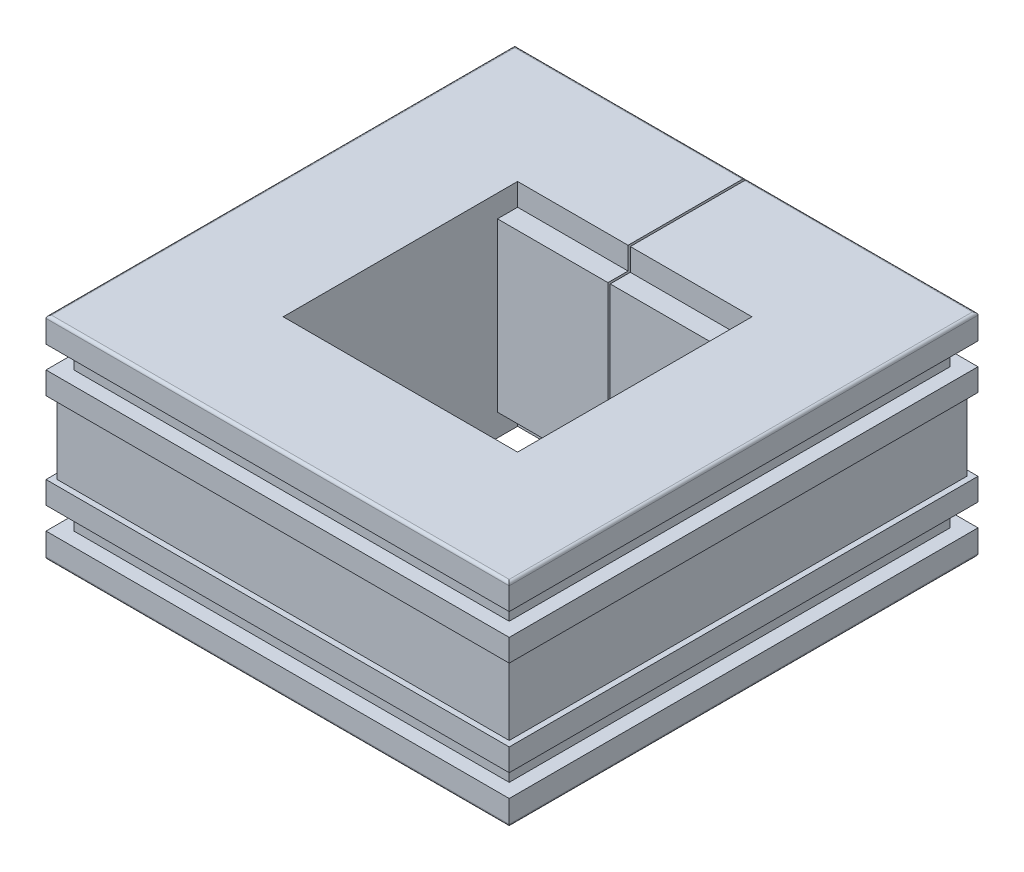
ISO-10303-21;
HEADER;
FILE_DESCRIPTION(('STEP AP214'),'2;1');
FILE_NAME('part.step','',(''),(''),'','','');
FILE_SCHEMA(('AUTOMOTIVE_DESIGN { 1 0 10303 214 1 1 1 1 }'));
ENDSEC;
DATA;
#1=APPLICATION_CONTEXT('core data for automotive mechanical design processes');
#2=APPLICATION_PROTOCOL_DEFINITION('international standard','automotive_design',2000,#1);
#3=PRODUCT_CONTEXT('',#1,'mechanical');
#4=PRODUCT('Part','Part','',(#3));
#5=PRODUCT_RELATED_PRODUCT_CATEGORY('part','',(#4));
#6=PRODUCT_DEFINITION_FORMATION('','',#4);
#7=PRODUCT_DEFINITION_CONTEXT('part definition',#1,'design');
#8=PRODUCT_DEFINITION('design','',#6,#7);
#9=PRODUCT_DEFINITION_SHAPE('','',#8);
#10=(LENGTH_UNIT() NAMED_UNIT(*) SI_UNIT(.MILLI.,.METRE.));
#11=(NAMED_UNIT(*) PLANE_ANGLE_UNIT() SI_UNIT($,.RADIAN.));
#12=(NAMED_UNIT(*) SI_UNIT($,.STERADIAN.) SOLID_ANGLE_UNIT());
#13=UNCERTAINTY_MEASURE_WITH_UNIT(LENGTH_MEASURE(1.E-05),#10,'distance_accuracy_value','');
#14=(GEOMETRIC_REPRESENTATION_CONTEXT(3) GLOBAL_UNCERTAINTY_ASSIGNED_CONTEXT((#13)) GLOBAL_UNIT_ASSIGNED_CONTEXT((#10,
#11,#12)) REPRESENTATION_CONTEXT('',''));
#15=CARTESIAN_POINT('',(0.,0.,0.));
#16=DIRECTION('',(0.,0.,1.));
#17=DIRECTION('',(1.,0.,0.));
#18=AXIS2_PLACEMENT_3D('',#15,#16,#17);
#19=CARTESIAN_POINT('',(0.100000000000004,40.0009523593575,0.));
#20=DIRECTION('',(-1.,0.,0.));
#21=DIRECTION('',(0.,1.,0.));
#22=AXIS2_PLACEMENT_3D('',#19,#20,#21);
#23=PLANE('',#22);
#24=DIRECTION('',(0.,0.,-1.));
#25=VECTOR('',#24,1.);
#26=CARTESIAN_POINT('',(0.0999999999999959,2.25,-21.));
#27=LINE('',#26,#25);
#28=CARTESIAN_POINT('',(0.0999999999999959,2.25,-19.75));
#29=VERTEX_POINT('',#28);
#30=CARTESIAN_POINT('',(0.0999999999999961,2.25,-21.));
#31=VERTEX_POINT('',#30);
#32=EDGE_CURVE('E680',#29,#31,#27,.T.);
#33=ORIENTED_EDGE('',*,*,#32,.T.);
#34=DIRECTION('',(0.,-1.,0.));
#35=VECTOR('',#34,1.);
#36=CARTESIAN_POINT('',(0.0999999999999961,40.0009523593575,-21.));
#37=LINE('',#36,#35);
#38=CARTESIAN_POINT('',(0.0999999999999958,0.25,-21.));
#39=VERTEX_POINT('',#38);
#40=EDGE_CURVE('E603',#31,#39,#37,.T.);
#41=ORIENTED_EDGE('',*,*,#40,.T.);
#42=CARTESIAN_POINT('',(0.0999999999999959,0.25,-20.75));
#43=DIRECTION('',(1.,0.,0.));
#44=DIRECTION('',(0.,0.,1.));
#45=AXIS2_PLACEMENT_3D('',#42,#43,#44);
#46=CIRCLE('',#45,0.25);
#47=CARTESIAN_POINT('',(0.0999999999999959,0.,-20.75));
#48=VERTEX_POINT('',#47);
#49=EDGE_CURVE('E1121',#48,#39,#46,.T.);
#50=ORIENTED_EDGE('',*,*,#49,.F.);
#51=DIRECTION('',(0.,0.,-1.));
#52=VECTOR('',#51,1.);
#53=CARTESIAN_POINT('',(0.100000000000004,0.,0.));
#54=LINE('',#53,#52);
#55=CARTESIAN_POINT('',(0.1,0.,-10.5));
#56=VERTEX_POINT('',#55);
#57=EDGE_CURVE('E930',#56,#48,#54,.T.);
#58=ORIENTED_EDGE('',*,*,#57,.F.);
#59=DIRECTION('',(0.,1.,0.));
#60=VECTOR('',#59,1.);
#61=CARTESIAN_POINT('',(0.1,2.,-10.5));
#62=LINE('',#61,#60);
#63=CARTESIAN_POINT('',(0.1,2.,-10.5));
#64=VERTEX_POINT('',#63);
#65=EDGE_CURVE('E569',#56,#64,#62,.T.);
#66=ORIENTED_EDGE('',*,*,#65,.T.);
#67=DIRECTION('',(0.,0.,-1.));
#68=VECTOR('',#67,1.);
#69=CARTESIAN_POINT('',(0.1,2.,-10.5));
#70=LINE('',#69,#68);
#71=CARTESIAN_POINT('',(0.1,2.,-8.7));
#72=VERTEX_POINT('',#71);
#73=EDGE_CURVE('E562',#72,#64,#70,.T.);
#74=ORIENTED_EDGE('',*,*,#73,.F.);
#75=DIRECTION('',(0.,1.,0.));
#76=VECTOR('',#75,1.);
#77=CARTESIAN_POINT('',(0.1,-1.,-8.7));
#78=LINE('',#77,#76);
#79=CARTESIAN_POINT('',(0.1,17.,-8.7));
#80=VERTEX_POINT('',#79);
#81=EDGE_CURVE('E567',#72,#80,#78,.T.);
#82=ORIENTED_EDGE('',*,*,#81,.T.);
#83=DIRECTION('',(0.,0.,1.));
#84=VECTOR('',#83,1.);
#85=CARTESIAN_POINT('',(0.100000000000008,17.,10.5));
#86=LINE('',#85,#84);
#87=CARTESIAN_POINT('',(0.1,17.,-10.5));
#88=VERTEX_POINT('',#87);
#89=EDGE_CURVE('E1206',#88,#80,#86,.T.);
#90=ORIENTED_EDGE('',*,*,#89,.F.);
#91=DIRECTION('',(0.,1.,0.));
#92=VECTOR('',#91,1.);
#93=CARTESIAN_POINT('',(0.1,17.,-10.5));
#94=LINE('',#93,#92);
#95=CARTESIAN_POINT('',(0.1,19.,-10.5));
#96=VERTEX_POINT('',#95);
#97=EDGE_CURVE('E1240',#88,#96,#94,.T.);
#98=ORIENTED_EDGE('',*,*,#97,.T.);
#99=DIRECTION('',(0.,0.,1.));
#100=VECTOR('',#99,1.);
#101=CARTESIAN_POINT('',(0.100000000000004,19.,0.));
#102=LINE('',#101,#100);
#103=CARTESIAN_POINT('',(0.0999999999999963,19.,-20.75));
#104=VERTEX_POINT('',#103);
#105=EDGE_CURVE('E1083',#104,#96,#102,.T.);
#106=ORIENTED_EDGE('',*,*,#105,.F.);
#107=CARTESIAN_POINT('',(0.0999999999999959,18.75,-20.75));
#108=DIRECTION('',(1.,0.,0.));
#109=DIRECTION('',(0.,0.,1.));
#110=AXIS2_PLACEMENT_3D('',#107,#108,#109);
#111=CIRCLE('',#110,0.25);
#112=CARTESIAN_POINT('',(0.0999999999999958,18.75,-21.));
#113=VERTEX_POINT('',#112);
#114=EDGE_CURVE('E1140',#113,#104,#111,.T.);
#115=ORIENTED_EDGE('',*,*,#114,.F.);
#116=DIRECTION('',(0.,-1.,0.));
#117=VECTOR('',#116,1.);
#118=CARTESIAN_POINT('',(0.0999999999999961,40.0009523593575,-21.));
#119=LINE('',#118,#117);
#120=CARTESIAN_POINT('',(0.0999999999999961,16.75,-21.));
#121=VERTEX_POINT('',#120);
#122=EDGE_CURVE('E910',#113,#121,#119,.T.);
#123=ORIENTED_EDGE('',*,*,#122,.T.);
#124=DIRECTION('',(0.,0.,-1.));
#125=VECTOR('',#124,1.);
#126=CARTESIAN_POINT('',(0.0999999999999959,16.75,-21.));
#127=LINE('',#126,#125);
#128=CARTESIAN_POINT('',(0.0999999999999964,16.75,-19.75));
#129=VERTEX_POINT('',#128);
#130=EDGE_CURVE('E728',#129,#121,#127,.T.);
#131=ORIENTED_EDGE('',*,*,#130,.F.);
#132=DIRECTION('',(0.,-1.,0.));
#133=VECTOR('',#132,1.);
#134=CARTESIAN_POINT('',(0.0999999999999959,16.75,-19.75));
#135=LINE('',#134,#133);
#136=CARTESIAN_POINT('',(0.0999999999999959,14.75,-19.75));
#137=VERTEX_POINT('',#136);
#138=EDGE_CURVE('E1056',#129,#137,#135,.T.);
#139=ORIENTED_EDGE('',*,*,#138,.T.);
#140=DIRECTION('',(0.,0.,-1.));
#141=VECTOR('',#140,1.);
#142=CARTESIAN_POINT('',(0.0999999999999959,14.75,-21.));
#143=LINE('',#142,#141);
#144=CARTESIAN_POINT('',(0.0999999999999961,14.75,-21.));
#145=VERTEX_POINT('',#144);
#146=EDGE_CURVE('E648',#137,#145,#143,.T.);
#147=ORIENTED_EDGE('',*,*,#146,.T.);
#148=DIRECTION('',(0.,-1.,0.));
#149=VECTOR('',#148,1.);
#150=CARTESIAN_POINT('',(0.0999999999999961,40.0009523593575,-21.));
#151=LINE('',#150,#149);
#152=CARTESIAN_POINT('',(0.0999999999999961,12.75,-21.));
#153=VERTEX_POINT('',#152);
#154=EDGE_CURVE('E1049',#145,#153,#151,.T.);
#155=ORIENTED_EDGE('',*,*,#154,.T.);
#156=DIRECTION('',(0.,0.,-1.));
#157=VECTOR('',#156,1.);
#158=CARTESIAN_POINT('',(0.0999999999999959,12.75,-21.));
#159=LINE('',#158,#157);
#160=CARTESIAN_POINT('',(0.0999999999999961,12.75,-20.5));
#161=VERTEX_POINT('',#160);
#162=EDGE_CURVE('E788',#161,#153,#159,.T.);
#163=ORIENTED_EDGE('',*,*,#162,.F.);
#164=DIRECTION('',(0.,-1.,0.));
#165=VECTOR('',#164,1.);
#166=CARTESIAN_POINT('',(0.0999999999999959,12.75,-20.5));
#167=LINE('',#166,#165);
#168=CARTESIAN_POINT('',(0.0999999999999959,6.25,-20.5));
#169=VERTEX_POINT('',#168);
#170=EDGE_CURVE('E747',#161,#169,#167,.T.);
#171=ORIENTED_EDGE('',*,*,#170,.T.);
#172=DIRECTION('',(0.,0.,-1.));
#173=VECTOR('',#172,1.);
#174=CARTESIAN_POINT('',(0.0999999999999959,6.25,-21.));
#175=LINE('',#174,#173);
#176=CARTESIAN_POINT('',(0.0999999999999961,6.25,-21.));
#177=VERTEX_POINT('',#176);
#178=EDGE_CURVE('E762',#169,#177,#175,.T.);
#179=ORIENTED_EDGE('',*,*,#178,.T.);
#180=DIRECTION('',(0.,-1.,0.));
#181=VECTOR('',#180,1.);
#182=CARTESIAN_POINT('',(0.0999999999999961,40.0009523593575,-21.));
#183=LINE('',#182,#181);
#184=CARTESIAN_POINT('',(0.0999999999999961,4.25,-21.));
#185=VERTEX_POINT('',#184);
#186=EDGE_CURVE('E729',#177,#185,#183,.T.);
#187=ORIENTED_EDGE('',*,*,#186,.T.);
#188=DIRECTION('',(0.,0.,-1.));
#189=VECTOR('',#188,1.);
#190=CARTESIAN_POINT('',(0.0999999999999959,4.25,-21.));
#191=LINE('',#190,#189);
#192=CARTESIAN_POINT('',(0.0999999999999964,4.25,-19.75));
#193=VERTEX_POINT('',#192);
#194=EDGE_CURVE('E875',#193,#185,#191,.T.);
#195=ORIENTED_EDGE('',*,*,#194,.F.);
#196=DIRECTION('',(0.,-1.,0.));
#197=VECTOR('',#196,1.);
#198=CARTESIAN_POINT('',(0.0999999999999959,4.25,-19.75));
#199=LINE('',#198,#197);
#200=EDGE_CURVE('E828',#193,#29,#199,.T.);
#201=ORIENTED_EDGE('',*,*,#200,.T.);
#202=EDGE_LOOP('',(#33,#41,#50,#58,#66,#74,#82,#90,#98,#106,#115,#123,#131,#139,#147,#155,#163,
#171,#179,#187,#195,#201));
#203=FACE_BOUND('',#202,.T.);
#204=ADVANCED_FACE('F15',(#203),#23,.T.);
#205=CARTESIAN_POINT('',(-0.100000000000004,40.0009523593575,0.));
#206=DIRECTION('',(1.,0.,0.));
#207=DIRECTION('',(0.,1.,0.));
#208=AXIS2_PLACEMENT_3D('',#205,#206,#207);
#209=PLANE('',#208);
#210=DIRECTION('',(0.,0.,1.));
#211=VECTOR('',#210,1.);
#212=CARTESIAN_POINT('',(-0.100000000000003,2.25,-21.));
#213=LINE('',#212,#211);
#214=CARTESIAN_POINT('',(-0.100000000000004,2.25,-21.));
#215=VERTEX_POINT('',#214);
#216=CARTESIAN_POINT('',(-0.100000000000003,2.25,-19.75));
#217=VERTEX_POINT('',#216);
#218=EDGE_CURVE('E874',#215,#217,#213,.T.);
#219=ORIENTED_EDGE('',*,*,#218,.T.);
#220=DIRECTION('',(0.,1.,0.));
#221=VECTOR('',#220,1.);
#222=CARTESIAN_POINT('',(-0.100000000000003,4.25,-19.75));
#223=LINE('',#222,#221);
#224=CARTESIAN_POINT('',(-0.100000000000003,4.25,-19.75));
#225=VERTEX_POINT('',#224);
#226=EDGE_CURVE('E997',#217,#225,#223,.T.);
#227=ORIENTED_EDGE('',*,*,#226,.T.);
#228=DIRECTION('',(0.,0.,1.));
#229=VECTOR('',#228,1.);
#230=CARTESIAN_POINT('',(-0.100000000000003,4.25,-21.));
#231=LINE('',#230,#229);
#232=CARTESIAN_POINT('',(-0.100000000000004,4.25,-21.));
#233=VERTEX_POINT('',#232);
#234=EDGE_CURVE('E617',#233,#225,#231,.T.);
#235=ORIENTED_EDGE('',*,*,#234,.F.);
#236=DIRECTION('',(0.,-1.,0.));
#237=VECTOR('',#236,1.);
#238=CARTESIAN_POINT('',(-0.100000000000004,40.0009523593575,-21.));
#239=LINE('',#238,#237);
#240=CARTESIAN_POINT('',(-0.100000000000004,6.25,-21.));
#241=VERTEX_POINT('',#240);
#242=EDGE_CURVE('E755',#241,#233,#239,.T.);
#243=ORIENTED_EDGE('',*,*,#242,.F.);
#244=DIRECTION('',(0.,0.,1.));
#245=VECTOR('',#244,1.);
#246=CARTESIAN_POINT('',(-0.100000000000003,6.25,-21.));
#247=LINE('',#246,#245);
#248=CARTESIAN_POINT('',(-0.100000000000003,6.25,-20.5));
#249=VERTEX_POINT('',#248);
#250=EDGE_CURVE('E797',#241,#249,#247,.T.);
#251=ORIENTED_EDGE('',*,*,#250,.T.);
#252=DIRECTION('',(0.,1.,0.));
#253=VECTOR('',#252,1.);
#254=CARTESIAN_POINT('',(-0.100000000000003,12.75,-20.5));
#255=LINE('',#254,#253);
#256=CARTESIAN_POINT('',(-0.100000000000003,12.75,-20.5));
#257=VERTEX_POINT('',#256);
#258=EDGE_CURVE('E948',#249,#257,#255,.T.);
#259=ORIENTED_EDGE('',*,*,#258,.T.);
#260=DIRECTION('',(0.,0.,1.));
#261=VECTOR('',#260,1.);
#262=CARTESIAN_POINT('',(-0.100000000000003,12.75,-21.));
#263=LINE('',#262,#261);
#264=CARTESIAN_POINT('',(-0.100000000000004,12.75,-21.));
#265=VERTEX_POINT('',#264);
#266=EDGE_CURVE('E826',#265,#257,#263,.T.);
#267=ORIENTED_EDGE('',*,*,#266,.F.);
#268=DIRECTION('',(0.,-1.,0.));
#269=VECTOR('',#268,1.);
#270=CARTESIAN_POINT('',(-0.100000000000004,40.0009523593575,-21.));
#271=LINE('',#270,#269);
#272=CARTESIAN_POINT('',(-0.100000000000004,14.75,-21.));
#273=VERTEX_POINT('',#272);
#274=EDGE_CURVE('E767',#273,#265,#271,.T.);
#275=ORIENTED_EDGE('',*,*,#274,.F.);
#276=DIRECTION('',(0.,0.,1.));
#277=VECTOR('',#276,1.);
#278=CARTESIAN_POINT('',(-0.100000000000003,14.75,-21.));
#279=LINE('',#278,#277);
#280=CARTESIAN_POINT('',(-0.100000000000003,14.75,-19.75));
#281=VERTEX_POINT('',#280);
#282=EDGE_CURVE('E630',#273,#281,#279,.T.);
#283=ORIENTED_EDGE('',*,*,#282,.T.);
#284=DIRECTION('',(0.,1.,0.));
#285=VECTOR('',#284,1.);
#286=CARTESIAN_POINT('',(-0.100000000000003,16.75,-19.75));
#287=LINE('',#286,#285);
#288=CARTESIAN_POINT('',(-0.100000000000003,16.75,-19.75));
#289=VERTEX_POINT('',#288);
#290=EDGE_CURVE('E1014',#281,#289,#287,.T.);
#291=ORIENTED_EDGE('',*,*,#290,.T.);
#292=DIRECTION('',(0.,0.,1.));
#293=VECTOR('',#292,1.);
#294=CARTESIAN_POINT('',(-0.100000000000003,16.75,-21.));
#295=LINE('',#294,#293);
#296=CARTESIAN_POINT('',(-0.100000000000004,16.75,-21.));
#297=VERTEX_POINT('',#296);
#298=EDGE_CURVE('E738',#297,#289,#295,.T.);
#299=ORIENTED_EDGE('',*,*,#298,.F.);
#300=DIRECTION('',(0.,-1.,0.));
#301=VECTOR('',#300,1.);
#302=CARTESIAN_POINT('',(-0.100000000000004,40.0009523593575,-21.));
#303=LINE('',#302,#301);
#304=CARTESIAN_POINT('',(-0.100000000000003,18.75,-21.));
#305=VERTEX_POINT('',#304);
#306=EDGE_CURVE('E989',#305,#297,#303,.T.);
#307=ORIENTED_EDGE('',*,*,#306,.F.);
#308=CARTESIAN_POINT('',(-0.100000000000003,18.75,-20.75));
#309=DIRECTION('',(-1.,0.,0.));
#310=DIRECTION('',(0.,0.,-1.));
#311=AXIS2_PLACEMENT_3D('',#308,#309,#310);
#312=CIRCLE('',#311,0.25);
#313=CARTESIAN_POINT('',(-0.100000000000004,19.,-20.75));
#314=VERTEX_POINT('',#313);
#315=EDGE_CURVE('E1152',#314,#305,#312,.T.);
#316=ORIENTED_EDGE('',*,*,#315,.F.);
#317=DIRECTION('',(0.,0.,-1.));
#318=VECTOR('',#317,1.);
#319=CARTESIAN_POINT('',(-0.100000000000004,19.,0.));
#320=LINE('',#319,#318);
#321=CARTESIAN_POINT('',(-0.100000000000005,19.,-10.5));
#322=VERTEX_POINT('',#321);
#323=EDGE_CURVE('E1097',#322,#314,#320,.T.);
#324=ORIENTED_EDGE('',*,*,#323,.F.);
#325=DIRECTION('',(0.,-1.,0.));
#326=VECTOR('',#325,1.);
#327=CARTESIAN_POINT('',(-0.100000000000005,17.,-10.5));
#328=LINE('',#327,#326);
#329=CARTESIAN_POINT('',(-0.100000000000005,17.,-10.5));
#330=VERTEX_POINT('',#329);
#331=EDGE_CURVE('E1246',#322,#330,#328,.T.);
#332=ORIENTED_EDGE('',*,*,#331,.T.);
#333=DIRECTION('',(0.,0.,-1.));
#334=VECTOR('',#333,1.);
#335=CARTESIAN_POINT('',(-0.100000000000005,17.,10.5));
#336=LINE('',#335,#334);
#337=CARTESIAN_POINT('',(-0.100000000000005,17.,-8.7));
#338=VERTEX_POINT('',#337);
#339=EDGE_CURVE('E1229',#338,#330,#336,.T.);
#340=ORIENTED_EDGE('',*,*,#339,.F.);
#341=DIRECTION('',(0.,-1.,0.));
#342=VECTOR('',#341,1.);
#343=CARTESIAN_POINT('',(-0.100000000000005,-1.,-8.7));
#344=LINE('',#343,#342);
#345=CARTESIAN_POINT('',(-0.100000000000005,2.,-8.7));
#346=VERTEX_POINT('',#345);
#347=EDGE_CURVE('E683',#338,#346,#344,.T.);
#348=ORIENTED_EDGE('',*,*,#347,.T.);
#349=DIRECTION('',(0.,0.,1.));
#350=VECTOR('',#349,1.);
#351=CARTESIAN_POINT('',(-0.100000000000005,2.,-10.5));
#352=LINE('',#351,#350);
#353=CARTESIAN_POINT('',(-0.100000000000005,2.,-10.5));
#354=VERTEX_POINT('',#353);
#355=EDGE_CURVE('E994',#354,#346,#352,.T.);
#356=ORIENTED_EDGE('',*,*,#355,.F.);
#357=DIRECTION('',(0.,-1.,0.));
#358=VECTOR('',#357,1.);
#359=CARTESIAN_POINT('',(-0.100000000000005,2.,-10.5));
#360=LINE('',#359,#358);
#361=CARTESIAN_POINT('',(-0.100000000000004,0.,-10.5));
#362=VERTEX_POINT('',#361);
#363=EDGE_CURVE('E1196',#354,#362,#360,.T.);
#364=ORIENTED_EDGE('',*,*,#363,.T.);
#365=DIRECTION('',(0.,0.,1.));
#366=VECTOR('',#365,1.);
#367=CARTESIAN_POINT('',(-0.100000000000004,0.,0.));
#368=LINE('',#367,#366);
#369=CARTESIAN_POINT('',(-0.100000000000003,0.,-20.75));
#370=VERTEX_POINT('',#369);
#371=EDGE_CURVE('E969',#370,#362,#368,.T.);
#372=ORIENTED_EDGE('',*,*,#371,.F.);
#373=CARTESIAN_POINT('',(-0.100000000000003,0.25,-20.75));
#374=DIRECTION('',(-1.,0.,0.));
#375=DIRECTION('',(0.,0.,-1.));
#376=AXIS2_PLACEMENT_3D('',#373,#374,#375);
#377=CIRCLE('',#376,0.25);
#378=CARTESIAN_POINT('',(-0.100000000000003,0.25,-21.));
#379=VERTEX_POINT('',#378);
#380=EDGE_CURVE('E1129',#379,#370,#377,.T.);
#381=ORIENTED_EDGE('',*,*,#380,.F.);
#382=DIRECTION('',(0.,-1.,0.));
#383=VECTOR('',#382,1.);
#384=CARTESIAN_POINT('',(-0.100000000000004,40.0009523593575,-21.));
#385=LINE('',#384,#383);
#386=EDGE_CURVE('E914',#215,#379,#385,.T.);
#387=ORIENTED_EDGE('',*,*,#386,.F.);
#388=EDGE_LOOP('',(#219,#227,#235,#243,#251,#259,#267,#275,#283,#291,#299,#307,#316,#324,#332,
#340,#348,#356,#364,#372,#381,#387));
#389=FACE_BOUND('',#388,.T.);
#390=ADVANCED_FACE('F1385',(#389),#209,.T.);
#391=CARTESIAN_POINT('',(-10.,17.,10.5));
#392=DIRECTION('',(0.,0.,1.));
#393=DIRECTION('',(1.,0.,0.));
#394=AXIS2_PLACEMENT_3D('',#391,#392,#393);
#395=PLANE('',#394);
#396=DIRECTION('',(1.,0.,0.));
#397=VECTOR('',#396,1.);
#398=CARTESIAN_POINT('',(-10.,19.,10.5));
#399=LINE('',#398,#397);
#400=CARTESIAN_POINT('',(-10.,19.,10.5));
#401=VERTEX_POINT('',#400);
#402=CARTESIAN_POINT('',(11.,19.,10.5));
#403=VERTEX_POINT('',#402);
#404=EDGE_CURVE('E614',#401,#403,#399,.T.);
#405=ORIENTED_EDGE('',*,*,#404,.T.);
#406=DIRECTION('',(0.,1.,0.));
#407=VECTOR('',#406,1.);
#408=CARTESIAN_POINT('',(11.,17.,10.5));
#409=LINE('',#408,#407);
#410=CARTESIAN_POINT('',(11.,17.,10.5));
#411=VERTEX_POINT('',#410);
#412=EDGE_CURVE('E9',#411,#403,#409,.T.);
#413=ORIENTED_EDGE('',*,*,#412,.F.);
#414=DIRECTION('',(1.,0.,0.));
#415=VECTOR('',#414,1.);
#416=CARTESIAN_POINT('',(-10.,17.,10.5));
#417=LINE('',#416,#415);
#418=CARTESIAN_POINT('',(-10.,17.,10.5));
#419=VERTEX_POINT('',#418);
#420=EDGE_CURVE('E1221',#419,#411,#417,.T.);
#421=ORIENTED_EDGE('',*,*,#420,.F.);
#422=DIRECTION('',(0.,1.,0.));
#423=VECTOR('',#422,1.);
#424=CARTESIAN_POINT('',(-10.,17.,10.5));
#425=LINE('',#424,#423);
#426=EDGE_CURVE('E1305',#419,#401,#425,.T.);
#427=ORIENTED_EDGE('',*,*,#426,.T.);
#428=EDGE_LOOP('',(#405,#413,#421,#427));
#429=FACE_BOUND('',#428,.T.);
#430=ADVANCED_FACE('F1414',(#429),#395,.F.);
#431=CARTESIAN_POINT('',(11.,17.,-10.5));
#432=DIRECTION('',(1.,0.,0.));
#433=DIRECTION('',(0.,1.,0.));
#434=AXIS2_PLACEMENT_3D('',#431,#432,#433);
#435=PLANE('',#434);
#436=DIRECTION('',(0.,0.,-1.));
#437=VECTOR('',#436,1.);
#438=CARTESIAN_POINT('',(11.,19.,-10.5));
#439=LINE('',#438,#437);
#440=CARTESIAN_POINT('',(11.,19.,-10.5));
#441=VERTEX_POINT('',#440);
#442=EDGE_CURVE('E611',#403,#441,#439,.T.);
#443=ORIENTED_EDGE('',*,*,#442,.T.);
#444=DIRECTION('',(0.,1.,0.));
#445=VECTOR('',#444,1.);
#446=CARTESIAN_POINT('',(11.,17.,-10.5));
#447=LINE('',#446,#445);
#448=CARTESIAN_POINT('',(11.,17.,-10.5));
#449=VERTEX_POINT('',#448);
#450=EDGE_CURVE('E1243',#449,#441,#447,.T.);
#451=ORIENTED_EDGE('',*,*,#450,.F.);
#452=DIRECTION('',(0.,0.,-1.));
#453=VECTOR('',#452,1.);
#454=CARTESIAN_POINT('',(11.,17.,-10.5));
#455=LINE('',#454,#453);
#456=EDGE_CURVE('E1225',#411,#449,#455,.T.);
#457=ORIENTED_EDGE('',*,*,#456,.F.);
#458=ORIENTED_EDGE('',*,*,#412,.T.);
#459=EDGE_LOOP('',(#443,#451,#457,#458));
#460=FACE_BOUND('',#459,.T.);
#461=ADVANCED_FACE('F1586',(#460),#435,.F.);
#462=CARTESIAN_POINT('',(11.,2.,10.5));
#463=DIRECTION('',(1.,0.,0.));
#464=DIRECTION('',(0.,0.,1.));
#465=AXIS2_PLACEMENT_3D('',#462,#463,#464);
#466=PLANE('',#465);
#467=DIRECTION('',(0.,0.,1.));
#468=VECTOR('',#467,1.);
#469=CARTESIAN_POINT('',(11.,0.,10.5));
#470=LINE('',#469,#468);
#471=CARTESIAN_POINT('',(11.,0.,-10.5));
#472=VERTEX_POINT('',#471);
#473=CARTESIAN_POINT('',(11.,0.,10.5));
#474=VERTEX_POINT('',#473);
#475=EDGE_CURVE('E599',#472,#474,#470,.T.);
#476=ORIENTED_EDGE('',*,*,#475,.T.);
#477=DIRECTION('',(0.,-1.,0.));
#478=VECTOR('',#477,1.);
#479=CARTESIAN_POINT('',(11.,2.,10.5));
#480=LINE('',#479,#478);
#481=CARTESIAN_POINT('',(11.,2.,10.5));
#482=VERTEX_POINT('',#481);
#483=EDGE_CURVE('E23',#482,#474,#480,.T.);
#484=ORIENTED_EDGE('',*,*,#483,.F.);
#485=DIRECTION('',(0.,0.,1.));
#486=VECTOR('',#485,1.);
#487=CARTESIAN_POINT('',(11.,2.,10.5));
#488=LINE('',#487,#486);
#489=CARTESIAN_POINT('',(11.,2.,-10.5));
#490=VERTEX_POINT('',#489);
#491=EDGE_CURVE('E1168',#490,#482,#488,.T.);
#492=ORIENTED_EDGE('',*,*,#491,.F.);
#493=DIRECTION('',(0.,-1.,0.));
#494=VECTOR('',#493,1.);
#495=CARTESIAN_POINT('',(11.,2.,-10.5));
#496=LINE('',#495,#494);
#497=EDGE_CURVE('E1193',#490,#472,#496,.T.);
#498=ORIENTED_EDGE('',*,*,#497,.T.);
#499=EDGE_LOOP('',(#476,#484,#492,#498));
#500=FACE_BOUND('',#499,.T.);
#501=ADVANCED_FACE('F1350',(#500),#466,.F.);
#502=CARTESIAN_POINT('',(-10.,2.,10.5));
#503=DIRECTION('',(0.,0.,1.));
#504=DIRECTION('',(1.,0.,0.));
#505=AXIS2_PLACEMENT_3D('',#502,#503,#504);
#506=PLANE('',#505);
#507=DIRECTION('',(-1.,0.,0.));
#508=VECTOR('',#507,1.);
#509=CARTESIAN_POINT('',(-10.,0.,10.5));
#510=LINE('',#509,#508);
#511=CARTESIAN_POINT('',(-10.,0.,10.5));
#512=VERTEX_POINT('',#511);
#513=EDGE_CURVE('E981',#474,#512,#510,.T.);
#514=ORIENTED_EDGE('',*,*,#513,.T.);
#515=DIRECTION('',(0.,-1.,0.));
#516=VECTOR('',#515,1.);
#517=CARTESIAN_POINT('',(-10.,2.,10.5));
#518=LINE('',#517,#516);
#519=CARTESIAN_POINT('',(-10.,2.,10.5));
#520=VERTEX_POINT('',#519);
#521=EDGE_CURVE('E1308',#520,#512,#518,.T.);
#522=ORIENTED_EDGE('',*,*,#521,.F.);
#523=DIRECTION('',(-1.,0.,0.));
#524=VECTOR('',#523,1.);
#525=CARTESIAN_POINT('',(-10.,2.,10.5));
#526=LINE('',#525,#524);
#527=EDGE_CURVE('E1172',#482,#520,#526,.T.);
#528=ORIENTED_EDGE('',*,*,#527,.F.);
#529=ORIENTED_EDGE('',*,*,#483,.T.);
#530=EDGE_LOOP('',(#514,#522,#528,#529));
#531=FACE_BOUND('',#530,.T.);
#532=ADVANCED_FACE('F1344',(#531),#506,.F.);
#533=CARTESIAN_POINT('',(-20.5,18.75,-21.));
#534=DIRECTION('',(0.,0.,1.));
#535=DIRECTION('',(1.,0.,0.));
#536=AXIS2_PLACEMENT_3D('',#533,#534,#535);
#537=CYLINDRICAL_SURFACE('',#536,0.25);
#538=CARTESIAN_POINT('',(-20.5,19.,-20.75));
#539=CARTESIAN_POINT('',(-20.6464466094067,19.,-20.8964466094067));
#540=CARTESIAN_POINT('',(-20.75,18.8964466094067,-21.));
#541=CARTESIAN_POINT('',(-20.75,18.75,-21.));
#542=(BOUNDED_CURVE() B_SPLINE_CURVE(3,(#538,#539,#540,#541),.UNSPECIFIED.,.F.,
.F.) B_SPLINE_CURVE_WITH_KNOTS((4,4),(4.71238898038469,6.28318530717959),
.UNSPECIFIED.) CURVE() GEOMETRIC_REPRESENTATION_ITEM() RATIONAL_B_SPLINE_CURVE((1.,
0.804737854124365,0.804737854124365,1.)) REPRESENTATION_ITEM(''));
#543=CARTESIAN_POINT('',(-20.5,19.,-20.75));
#544=VERTEX_POINT('',#543);
#545=CARTESIAN_POINT('',(-20.75,18.75,-21.));
#546=VERTEX_POINT('',#545);
#547=EDGE_CURVE('E575',#544,#546,#542,.T.);
#548=ORIENTED_EDGE('',*,*,#547,.T.);
#549=DIRECTION('',(0.,0.,-1.));
#550=VECTOR('',#549,1.);
#551=CARTESIAN_POINT('',(-20.75,18.75,21.));
#552=LINE('',#551,#550);
#553=CARTESIAN_POINT('',(-20.75,18.75,21.));
#554=VERTEX_POINT('',#553);
#555=EDGE_CURVE('E884',#554,#546,#552,.T.);
#556=ORIENTED_EDGE('',*,*,#555,.F.);
#557=CARTESIAN_POINT('',(-20.75,18.75,21.));
#558=CARTESIAN_POINT('',(-20.75,18.8964466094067,21.));
#559=CARTESIAN_POINT('',(-20.6464466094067,19.,20.8964466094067));
#560=CARTESIAN_POINT('',(-20.5,19.,20.75));
#561=(BOUNDED_CURVE() B_SPLINE_CURVE(3,(#557,#558,#559,#560),.UNSPECIFIED.,.F.,
.F.) B_SPLINE_CURVE_WITH_KNOTS((4,4),(3.1415926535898,4.71238898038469),
.UNSPECIFIED.) CURVE() GEOMETRIC_REPRESENTATION_ITEM() RATIONAL_B_SPLINE_CURVE((1.,
0.804737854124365,0.804737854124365,1.)) REPRESENTATION_ITEM(''));
#562=CARTESIAN_POINT('',(-20.5,19.,20.75));
#563=VERTEX_POINT('',#562);
#564=EDGE_CURVE('E42',#554,#563,#561,.T.);
#565=ORIENTED_EDGE('',*,*,#564,.T.);
#566=DIRECTION('',(0.,0.,1.));
#567=VECTOR('',#566,1.);
#568=CARTESIAN_POINT('',(-20.5,19.,-21.));
#569=LINE('',#568,#567);
#570=EDGE_CURVE('E1105',#544,#563,#569,.T.);
#571=ORIENTED_EDGE('',*,*,#570,.F.);
#572=EDGE_LOOP('',(#548,#556,#565,#571));
#573=FACE_BOUND('',#572,.T.);
#574=ADVANCED_FACE('F1553',(#573),#537,.T.);
#575=CARTESIAN_POINT('',(-20.75,18.75,20.75));
#576=DIRECTION('',(1.,0.,0.));
#577=DIRECTION('',(0.,0.,-1.));
#578=AXIS2_PLACEMENT_3D('',#575,#576,#577);
#579=CYLINDRICAL_SURFACE('',#578,0.25);
#580=CARTESIAN_POINT('',(20.75,18.75,21.));
#581=CARTESIAN_POINT('',(20.75,18.8964466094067,21.));
#582=CARTESIAN_POINT('',(20.6464466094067,19.,20.8964466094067));
#583=CARTESIAN_POINT('',(20.5,19.,20.75));
#584=(BOUNDED_CURVE() B_SPLINE_CURVE(3,(#580,#581,#582,#583),.UNSPECIFIED.,.F.,
.F.) B_SPLINE_CURVE_WITH_KNOTS((4,4),(0.,1.5707963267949),
.UNSPECIFIED.) CURVE() GEOMETRIC_REPRESENTATION_ITEM() RATIONAL_B_SPLINE_CURVE((1.,
0.804737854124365,0.804737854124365,1.)) REPRESENTATION_ITEM(''));
#585=CARTESIAN_POINT('',(20.75,18.75,21.));
#586=VERTEX_POINT('',#585);
#587=CARTESIAN_POINT('',(20.5,19.,20.75));
#588=VERTEX_POINT('',#587);
#589=EDGE_CURVE('E33',#586,#588,#584,.T.);
#590=ORIENTED_EDGE('',*,*,#589,.T.);
#591=DIRECTION('',(1.,0.,0.));
#592=VECTOR('',#591,1.);
#593=CARTESIAN_POINT('',(-20.75,19.,20.75));
#594=LINE('',#593,#592);
#595=EDGE_CURVE('E1109',#563,#588,#594,.T.);
#596=ORIENTED_EDGE('',*,*,#595,.F.);
#597=ORIENTED_EDGE('',*,*,#564,.F.);
#598=DIRECTION('',(-1.,0.,0.));
#599=VECTOR('',#598,1.);
#600=CARTESIAN_POINT('',(-20.75,18.75,21.));
#601=LINE('',#600,#599);
#602=EDGE_CURVE('E883',#586,#554,#601,.T.);
#603=ORIENTED_EDGE('',*,*,#602,.F.);
#604=EDGE_LOOP('',(#590,#596,#597,#603));
#605=FACE_BOUND('',#604,.T.);
#606=ADVANCED_FACE('F1556',(#605),#579,.T.);
#607=CARTESIAN_POINT('',(20.5,18.75,-21.));
#608=DIRECTION('',(0.,0.,-1.));
#609=DIRECTION('',(-1.,0.,0.));
#610=AXIS2_PLACEMENT_3D('',#607,#608,#609);
#611=CYLINDRICAL_SURFACE('',#610,0.25);
#612=ORIENTED_EDGE('',*,*,#589,.F.);
#613=DIRECTION('',(0.,0.,1.));
#614=VECTOR('',#613,1.);
#615=CARTESIAN_POINT('',(20.75,18.75,21.));
#616=LINE('',#615,#614);
#617=CARTESIAN_POINT('',(20.75,18.75,-21.));
#618=VERTEX_POINT('',#617);
#619=EDGE_CURVE('E893',#618,#586,#616,.T.);
#620=ORIENTED_EDGE('',*,*,#619,.F.);
#621=CARTESIAN_POINT('',(20.5,19.,-20.75));
#622=CARTESIAN_POINT('',(20.6464466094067,19.,-20.8964466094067));
#623=CARTESIAN_POINT('',(20.75,18.8964466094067,-21.));
#624=CARTESIAN_POINT('',(20.75,18.75,-21.));
#625=(BOUNDED_CURVE() B_SPLINE_CURVE(3,(#621,#622,#623,#624),.UNSPECIFIED.,.F.,
.F.) B_SPLINE_CURVE_WITH_KNOTS((4,4),(4.71238898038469,6.28318530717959),
.UNSPECIFIED.) CURVE() GEOMETRIC_REPRESENTATION_ITEM() RATIONAL_B_SPLINE_CURVE((1.,
0.804737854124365,0.804737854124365,1.)) REPRESENTATION_ITEM(''));
#626=CARTESIAN_POINT('',(20.5,19.,-20.75));
#627=VERTEX_POINT('',#626);
#628=EDGE_CURVE('E1146',#627,#618,#625,.T.);
#629=ORIENTED_EDGE('',*,*,#628,.F.);
#630=DIRECTION('',(0.,0.,-1.));
#631=VECTOR('',#630,1.);
#632=CARTESIAN_POINT('',(20.5,19.,-21.));
#633=LINE('',#632,#631);
#634=EDGE_CURVE('E1113',#588,#627,#633,.T.);
#635=ORIENTED_EDGE('',*,*,#634,.F.);
#636=EDGE_LOOP('',(#612,#620,#629,#635));
#637=FACE_BOUND('',#636,.T.);
#638=ADVANCED_FACE('F1558',(#637),#611,.T.);
#639=CARTESIAN_POINT('',(-20.5,0.25,21.));
#640=DIRECTION('',(0.,0.,-1.));
#641=DIRECTION('',(-1.,0.,0.));
#642=AXIS2_PLACEMENT_3D('',#639,#640,#641);
#643=CYLINDRICAL_SURFACE('',#642,0.25);
#644=CARTESIAN_POINT('',(-20.75,0.25,-21.));
#645=CARTESIAN_POINT('',(-20.75,0.103553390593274,-21.));
#646=CARTESIAN_POINT('',(-20.6464466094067,0.,-20.8964466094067));
#647=CARTESIAN_POINT('',(-20.5,0.,-20.75));
#648=(BOUNDED_CURVE() B_SPLINE_CURVE(3,(#644,#645,#646,#647),.UNSPECIFIED.,.F.,
.F.) B_SPLINE_CURVE_WITH_KNOTS((4,4),(3.1415926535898,4.71238898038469),
.UNSPECIFIED.) CURVE() GEOMETRIC_REPRESENTATION_ITEM() RATIONAL_B_SPLINE_CURVE((1.,
0.804737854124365,0.804737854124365,1.)) REPRESENTATION_ITEM(''));
#649=CARTESIAN_POINT('',(-20.75,0.25,-21.));
#650=VERTEX_POINT('',#649);
#651=CARTESIAN_POINT('',(-20.5,0.,-20.75));
#652=VERTEX_POINT('',#651);
#653=EDGE_CURVE('E1135',#650,#652,#648,.T.);
#654=ORIENTED_EDGE('',*,*,#653,.T.);
#655=DIRECTION('',(0.,0.,-1.));
#656=VECTOR('',#655,1.);
#657=CARTESIAN_POINT('',(-20.5,0.,-21.));
#658=LINE('',#657,#656);
#659=CARTESIAN_POINT('',(-20.5,0.,20.75));
#660=VERTEX_POINT('',#659);
#661=EDGE_CURVE('E956',#660,#652,#658,.T.);
#662=ORIENTED_EDGE('',*,*,#661,.F.);
#663=CARTESIAN_POINT('',(-20.5,0.,20.75));
#664=CARTESIAN_POINT('',(-20.6464466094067,0.,20.8964466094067));
#665=CARTESIAN_POINT('',(-20.75,0.103553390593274,21.));
#666=CARTESIAN_POINT('',(-20.75,0.25,21.));
#667=(BOUNDED_CURVE() B_SPLINE_CURVE(3,(#663,#664,#665,#666),.UNSPECIFIED.,.F.,
.F.) B_SPLINE_CURVE_WITH_KNOTS((4,4),(4.71238898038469,6.28318530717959),
.UNSPECIFIED.) CURVE() GEOMETRIC_REPRESENTATION_ITEM() RATIONAL_B_SPLINE_CURVE((1.,
0.804737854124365,0.804737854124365,1.)) REPRESENTATION_ITEM(''));
#668=CARTESIAN_POINT('',(-20.75,0.25,21.));
#669=VERTEX_POINT('',#668);
#670=EDGE_CURVE('E1316',#660,#669,#667,.T.);
#671=ORIENTED_EDGE('',*,*,#670,.T.);
#672=DIRECTION('',(0.,0.,1.));
#673=VECTOR('',#672,1.);
#674=CARTESIAN_POINT('',(-20.75,0.25,21.));
#675=LINE('',#674,#673);
#676=EDGE_CURVE('E1258',#650,#669,#675,.T.);
#677=ORIENTED_EDGE('',*,*,#676,.F.);
#678=EDGE_LOOP('',(#654,#662,#671,#677));
#679=FACE_BOUND('',#678,.T.);
#680=ADVANCED_FACE('F1377',(#679),#643,.T.);
#681=CARTESIAN_POINT('',(-20.75,0.25,20.75));
#682=DIRECTION('',(-1.,0.,0.));
#683=DIRECTION('',(0.,0.,1.));
#684=AXIS2_PLACEMENT_3D('',#681,#682,#683);
#685=CYLINDRICAL_SURFACE('',#684,0.25);
#686=CARTESIAN_POINT('',(20.5,0.,20.75));
#687=CARTESIAN_POINT('',(20.6464466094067,0.,20.8964466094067));
#688=CARTESIAN_POINT('',(20.75,0.103553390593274,21.));
#689=CARTESIAN_POINT('',(20.75,0.25,21.));
#690=(BOUNDED_CURVE() B_SPLINE_CURVE(3,(#686,#687,#688,#689),.UNSPECIFIED.,.F.,
.F.) B_SPLINE_CURVE_WITH_KNOTS((4,4),(4.71238898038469,6.28318530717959),
.UNSPECIFIED.) CURVE() GEOMETRIC_REPRESENTATION_ITEM() RATIONAL_B_SPLINE_CURVE((1.,
0.804737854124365,0.804737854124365,1.)) REPRESENTATION_ITEM(''));
#691=CARTESIAN_POINT('',(20.5,0.,20.75));
#692=VERTEX_POINT('',#691);
#693=CARTESIAN_POINT('',(20.75,0.25,21.));
#694=VERTEX_POINT('',#693);
#695=EDGE_CURVE('E1311',#692,#694,#690,.T.);
#696=ORIENTED_EDGE('',*,*,#695,.T.);
#697=DIRECTION('',(1.,0.,0.));
#698=VECTOR('',#697,1.);
#699=CARTESIAN_POINT('',(20.75,0.25,21.));
#700=LINE('',#699,#698);
#701=EDGE_CURVE('E1266',#669,#694,#700,.T.);
#702=ORIENTED_EDGE('',*,*,#701,.F.);
#703=ORIENTED_EDGE('',*,*,#670,.F.);
#704=DIRECTION('',(-1.,0.,0.));
#705=VECTOR('',#704,1.);
#706=CARTESIAN_POINT('',(-20.75,0.,20.75));
#707=LINE('',#706,#705);
#708=EDGE_CURVE('E947',#692,#660,#707,.T.);
#709=ORIENTED_EDGE('',*,*,#708,.F.);
#710=EDGE_LOOP('',(#696,#702,#703,#709));
#711=FACE_BOUND('',#710,.T.);
#712=ADVANCED_FACE('F1374',(#711),#685,.T.);
#713=CARTESIAN_POINT('',(20.5,0.25,21.));
#714=DIRECTION('',(0.,0.,1.));
#715=DIRECTION('',(1.,0.,0.));
#716=AXIS2_PLACEMENT_3D('',#713,#714,#715);
#717=CYLINDRICAL_SURFACE('',#716,0.25);
#718=ORIENTED_EDGE('',*,*,#695,.F.);
#719=DIRECTION('',(0.,0.,1.));
#720=VECTOR('',#719,1.);
#721=CARTESIAN_POINT('',(20.5,0.,21.));
#722=LINE('',#721,#720);
#723=CARTESIAN_POINT('',(20.5,0.,-20.75));
#724=VERTEX_POINT('',#723);
#725=EDGE_CURVE('E943',#724,#692,#722,.T.);
#726=ORIENTED_EDGE('',*,*,#725,.F.);
#727=CARTESIAN_POINT('',(20.75,0.25,-21.));
#728=CARTESIAN_POINT('',(20.75,0.103553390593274,-21.));
#729=CARTESIAN_POINT('',(20.6464466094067,0.,-20.8964466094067));
#730=CARTESIAN_POINT('',(20.5,0.,-20.75));
#731=(BOUNDED_CURVE() B_SPLINE_CURVE(3,(#727,#728,#729,#730),.UNSPECIFIED.,.F.,
.F.) B_SPLINE_CURVE_WITH_KNOTS((4,4),(0.,1.5707963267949),
.UNSPECIFIED.) CURVE() GEOMETRIC_REPRESENTATION_ITEM() RATIONAL_B_SPLINE_CURVE((1.,
0.804737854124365,0.804737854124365,1.)) REPRESENTATION_ITEM(''));
#732=CARTESIAN_POINT('',(20.75,0.25,-21.));
#733=VERTEX_POINT('',#732);
#734=EDGE_CURVE('E1124',#733,#724,#731,.T.);
#735=ORIENTED_EDGE('',*,*,#734,.F.);
#736=DIRECTION('',(0.,0.,-1.));
#737=VECTOR('',#736,1.);
#738=CARTESIAN_POINT('',(20.75,0.25,-21.));
#739=LINE('',#738,#737);
#740=EDGE_CURVE('E1274',#694,#733,#739,.T.);
#741=ORIENTED_EDGE('',*,*,#740,.F.);
#742=EDGE_LOOP('',(#718,#726,#735,#741));
#743=FACE_BOUND('',#742,.T.);
#744=ADVANCED_FACE('F1370',(#743),#717,.T.);
#745=CARTESIAN_POINT('',(-10.,-1.,-8.7));
#746=DIRECTION('',(-1.,0.,0.));
#747=DIRECTION('',(0.,1.,0.));
#748=AXIS2_PLACEMENT_3D('',#745,#746,#747);
#749=PLANE('',#748);
#750=DIRECTION('',(0.,0.,1.));
#751=VECTOR('',#750,1.);
#752=CARTESIAN_POINT('',(-10.,19.,-8.7));
#753=LINE('',#752,#751);
#754=CARTESIAN_POINT('',(-10.,19.,-10.5));
#755=VERTEX_POINT('',#754);
#756=EDGE_CURVE('E652',#755,#401,#753,.T.);
#757=ORIENTED_EDGE('',*,*,#756,.T.);
#758=ORIENTED_EDGE('',*,*,#426,.F.);
#759=DIRECTION('',(0.,0.,1.));
#760=VECTOR('',#759,1.);
#761=CARTESIAN_POINT('',(-10.,17.,-10.5));
#762=LINE('',#761,#760);
#763=CARTESIAN_POINT('',(-10.,17.,8.7));
#764=VERTEX_POINT('',#763);
#765=EDGE_CURVE('E1217',#764,#419,#762,.T.);
#766=ORIENTED_EDGE('',*,*,#765,.F.);
#767=DIRECTION('',(0.,1.,0.));
#768=VECTOR('',#767,1.);
#769=CARTESIAN_POINT('',(-10.,-1.,8.7));
#770=LINE('',#769,#768);
#771=CARTESIAN_POINT('',(-10.,2.,8.7));
#772=VERTEX_POINT('',#771);
#773=EDGE_CURVE('E1255',#772,#764,#770,.T.);
#774=ORIENTED_EDGE('',*,*,#773,.F.);
#775=DIRECTION('',(0.,0.,-1.));
#776=VECTOR('',#775,1.);
#777=CARTESIAN_POINT('',(-10.,2.,10.5));
#778=LINE('',#777,#776);
#779=EDGE_CURVE('E1176',#520,#772,#778,.T.);
#780=ORIENTED_EDGE('',*,*,#779,.F.);
#781=ORIENTED_EDGE('',*,*,#521,.T.);
#782=DIRECTION('',(0.,0.,-1.));
#783=VECTOR('',#782,1.);
#784=CARTESIAN_POINT('',(-10.,0.,-21.));
#785=LINE('',#784,#783);
#786=CARTESIAN_POINT('',(-10.,0.,-10.5));
#787=VERTEX_POINT('',#786);
#788=EDGE_CURVE('E977',#512,#787,#785,.T.);
#789=ORIENTED_EDGE('',*,*,#788,.T.);
#790=DIRECTION('',(0.,-1.,0.));
#791=VECTOR('',#790,1.);
#792=CARTESIAN_POINT('',(-10.,2.,-10.5));
#793=LINE('',#792,#791);
#794=CARTESIAN_POINT('',(-10.,2.,-10.5));
#795=VERTEX_POINT('',#794);
#796=EDGE_CURVE('E1199',#795,#787,#793,.T.);
#797=ORIENTED_EDGE('',*,*,#796,.F.);
#798=DIRECTION('',(0.,0.,-1.));
#799=VECTOR('',#798,1.);
#800=CARTESIAN_POINT('',(-10.,2.,10.5));
#801=LINE('',#800,#799);
#802=CARTESIAN_POINT('',(-10.,2.,-8.7));
#803=VERTEX_POINT('',#802);
#804=EDGE_CURVE('E990',#803,#795,#801,.T.);
#805=ORIENTED_EDGE('',*,*,#804,.F.);
#806=DIRECTION('',(0.,1.,0.));
#807=VECTOR('',#806,1.);
#808=CARTESIAN_POINT('',(-10.,-1.,-8.7));
#809=LINE('',#808,#807);
#810=CARTESIAN_POINT('',(-10.,17.,-8.7));
#811=VERTEX_POINT('',#810);
#812=EDGE_CURVE('E691',#803,#811,#809,.T.);
#813=ORIENTED_EDGE('',*,*,#812,.T.);
#814=DIRECTION('',(0.,0.,1.));
#815=VECTOR('',#814,1.);
#816=CARTESIAN_POINT('',(-10.,17.,-10.5));
#817=LINE('',#816,#815);
#818=CARTESIAN_POINT('',(-10.,17.,-10.5));
#819=VERTEX_POINT('',#818);
#820=EDGE_CURVE('E1237',#819,#811,#817,.T.);
#821=ORIENTED_EDGE('',*,*,#820,.F.);
#822=DIRECTION('',(0.,1.,0.));
#823=VECTOR('',#822,1.);
#824=CARTESIAN_POINT('',(-10.,17.,-10.5));
#825=LINE('',#824,#823);
#826=EDGE_CURVE('E1249',#819,#755,#825,.T.);
#827=ORIENTED_EDGE('',*,*,#826,.T.);
#828=EDGE_LOOP('',(#757,#758,#766,#774,#780,#781,#789,#797,#805,#813,#821,#827));
#829=FACE_BOUND('',#828,.T.);
#830=ADVANCED_FACE('F1356',(#829),#749,.F.);
#831=CARTESIAN_POINT('',(20.75,19.,21.));
#832=DIRECTION('',(-1.,0.,0.));
#833=DIRECTION('',(0.,0.,1.));
#834=AXIS2_PLACEMENT_3D('',#831,#832,#833);
#835=PLANE('',#834);
#836=DIRECTION('',(0.,-1.,0.));
#837=VECTOR('',#836,1.);
#838=CARTESIAN_POINT('',(20.75,19.,-21.));
#839=LINE('',#838,#837);
#840=CARTESIAN_POINT('',(20.75,16.75,-21.));
#841=VERTEX_POINT('',#840);
#842=EDGE_CURVE('E909',#618,#841,#839,.T.);
#843=ORIENTED_EDGE('',*,*,#842,.F.);
#844=ORIENTED_EDGE('',*,*,#619,.T.);
#845=DIRECTION('',(0.,-1.,0.));
#846=VECTOR('',#845,1.);
#847=CARTESIAN_POINT('',(20.75,19.,21.));
#848=LINE('',#847,#846);
#849=CARTESIAN_POINT('',(20.75,16.75,21.));
#850=VERTEX_POINT('',#849);
#851=EDGE_CURVE('E880',#586,#850,#848,.T.);
#852=ORIENTED_EDGE('',*,*,#851,.T.);
#853=DIRECTION('',(0.,0.,-1.));
#854=VECTOR('',#853,1.);
#855=CARTESIAN_POINT('',(20.75,16.75,21.));
#856=LINE('',#855,#854);
#857=EDGE_CURVE('E655',#850,#841,#856,.T.);
#858=ORIENTED_EDGE('',*,*,#857,.T.);
#859=EDGE_LOOP('',(#843,#844,#852,#858));
#860=FACE_BOUND('',#859,.T.);
#861=ADVANCED_FACE('F1560',(#860),#835,.F.);
#862=CARTESIAN_POINT('',(-20.75,19.,21.));
#863=DIRECTION('',(0.,0.,-1.));
#864=DIRECTION('',(0.,-1.,0.));
#865=AXIS2_PLACEMENT_3D('',#862,#863,#864);
#866=PLANE('',#865);
#867=ORIENTED_EDGE('',*,*,#851,.F.);
#868=ORIENTED_EDGE('',*,*,#602,.T.);
#869=DIRECTION('',(0.,-1.,0.));
#870=VECTOR('',#869,1.);
#871=CARTESIAN_POINT('',(-20.75,19.,21.));
#872=LINE('',#871,#870);
#873=CARTESIAN_POINT('',(-20.75,16.75,21.));
#874=VERTEX_POINT('',#873);
#875=EDGE_CURVE('E1298',#554,#874,#872,.T.);
#876=ORIENTED_EDGE('',*,*,#875,.T.);
#877=DIRECTION('',(1.,0.,0.));
#878=VECTOR('',#877,1.);
#879=CARTESIAN_POINT('',(-20.75,16.75,21.));
#880=LINE('',#879,#878);
#881=EDGE_CURVE('E659',#874,#850,#880,.T.);
#882=ORIENTED_EDGE('',*,*,#881,.T.);
#883=EDGE_LOOP('',(#867,#868,#876,#882));
#884=FACE_BOUND('',#883,.T.);
#885=ADVANCED_FACE('F1562',(#884),#866,.F.);
#886=CARTESIAN_POINT('',(-20.75,19.,21.));
#887=DIRECTION('',(1.,0.,0.));
#888=DIRECTION('',(0.,1.,0.));
#889=AXIS2_PLACEMENT_3D('',#886,#887,#888);
#890=PLANE('',#889);
#891=ORIENTED_EDGE('',*,*,#875,.F.);
#892=ORIENTED_EDGE('',*,*,#555,.T.);
#893=DIRECTION('',(0.,-1.,0.));
#894=VECTOR('',#893,1.);
#895=CARTESIAN_POINT('',(-20.75,19.,-21.));
#896=LINE('',#895,#894);
#897=CARTESIAN_POINT('',(-20.75,16.75,-21.));
#898=VERTEX_POINT('',#897);
#899=EDGE_CURVE('E985',#546,#898,#896,.T.);
#900=ORIENTED_EDGE('',*,*,#899,.T.);
#901=DIRECTION('',(0.,0.,1.));
#902=VECTOR('',#901,1.);
#903=CARTESIAN_POINT('',(-20.75,16.75,21.));
#904=LINE('',#903,#902);
#905=EDGE_CURVE('E716',#898,#874,#904,.T.);
#906=ORIENTED_EDGE('',*,*,#905,.T.);
#907=EDGE_LOOP('',(#891,#892,#900,#906));
#908=FACE_BOUND('',#907,.T.);
#909=ADVANCED_FACE('F1564',(#908),#890,.F.);
#910=CARTESIAN_POINT('',(19.5,16.75,19.75));
#911=DIRECTION('',(-1.,0.,0.));
#912=DIRECTION('',(0.,0.,1.));
#913=AXIS2_PLACEMENT_3D('',#910,#911,#912);
#914=PLANE('',#913);
#915=DIRECTION('',(0.,0.,-1.));
#916=VECTOR('',#915,1.);
#917=CARTESIAN_POINT('',(19.5,14.75,19.75));
#918=LINE('',#917,#916);
#919=CARTESIAN_POINT('',(19.5,14.75,19.75));
#920=VERTEX_POINT('',#919);
#921=CARTESIAN_POINT('',(19.5,14.75,-19.75));
#922=VERTEX_POINT('',#921);
#923=EDGE_CURVE('E647',#920,#922,#918,.T.);
#924=ORIENTED_EDGE('',*,*,#923,.T.);
#925=DIRECTION('',(0.,-1.,0.));
#926=VECTOR('',#925,1.);
#927=CARTESIAN_POINT('',(19.5,16.75,-19.75));
#928=LINE('',#927,#926);
#929=CARTESIAN_POINT('',(19.5,16.75,-19.75));
#930=VERTEX_POINT('',#929);
#931=EDGE_CURVE('E1063',#930,#922,#928,.T.);
#932=ORIENTED_EDGE('',*,*,#931,.F.);
#933=DIRECTION('',(0.,0.,-1.));
#934=VECTOR('',#933,1.);
#935=CARTESIAN_POINT('',(19.5,16.75,19.75));
#936=LINE('',#935,#934);
#937=CARTESIAN_POINT('',(19.5,16.75,19.75));
#938=VERTEX_POINT('',#937);
#939=EDGE_CURVE('E863',#938,#930,#936,.T.);
#940=ORIENTED_EDGE('',*,*,#939,.F.);
#941=DIRECTION('',(0.,-1.,0.));
#942=VECTOR('',#941,1.);
#943=CARTESIAN_POINT('',(19.5,16.75,19.75));
#944=LINE('',#943,#942);
#945=EDGE_CURVE('E1295',#938,#920,#944,.T.);
#946=ORIENTED_EDGE('',*,*,#945,.T.);
#947=EDGE_LOOP('',(#924,#932,#940,#946));
#948=FACE_BOUND('',#947,.T.);
#949=ADVANCED_FACE('F1566',(#948),#914,.F.);
#950=CARTESIAN_POINT('',(-19.5,16.75,19.75));
#951=DIRECTION('',(0.,0.,-1.));
#952=DIRECTION('',(0.,-1.,0.));
#953=AXIS2_PLACEMENT_3D('',#950,#951,#952);
#954=PLANE('',#953);
#955=DIRECTION('',(1.,0.,0.));
#956=VECTOR('',#955,1.);
#957=CARTESIAN_POINT('',(-19.5,14.75,19.75));
#958=LINE('',#957,#956);
#959=CARTESIAN_POINT('',(-19.5,14.75,19.75));
#960=VERTEX_POINT('',#959);
#961=EDGE_CURVE('E610',#960,#920,#958,.T.);
#962=ORIENTED_EDGE('',*,*,#961,.T.);
#963=ORIENTED_EDGE('',*,*,#945,.F.);
#964=DIRECTION('',(1.,0.,0.));
#965=VECTOR('',#964,1.);
#966=CARTESIAN_POINT('',(-19.5,16.75,19.75));
#967=LINE('',#966,#965);
#968=CARTESIAN_POINT('',(-19.5,16.75,19.75));
#969=VERTEX_POINT('',#968);
#970=EDGE_CURVE('E855',#969,#938,#967,.T.);
#971=ORIENTED_EDGE('',*,*,#970,.F.);
#972=DIRECTION('',(0.,-1.,0.));
#973=VECTOR('',#972,1.);
#974=CARTESIAN_POINT('',(-19.5,16.75,19.75));
#975=LINE('',#974,#973);
#976=EDGE_CURVE('E1292',#969,#960,#975,.T.);
#977=ORIENTED_EDGE('',*,*,#976,.T.);
#978=EDGE_LOOP('',(#962,#963,#971,#977));
#979=FACE_BOUND('',#978,.T.);
#980=ADVANCED_FACE('F1573',(#979),#954,.F.);
#981=CARTESIAN_POINT('',(-19.5,16.75,19.75));
#982=DIRECTION('',(1.,0.,0.));
#983=DIRECTION('',(0.,1.,0.));
#984=AXIS2_PLACEMENT_3D('',#981,#982,#983);
#985=PLANE('',#984);
#986=DIRECTION('',(0.,0.,1.));
#987=VECTOR('',#986,1.);
#988=CARTESIAN_POINT('',(-19.5,14.75,19.75));
#989=LINE('',#988,#987);
#990=CARTESIAN_POINT('',(-19.5,14.75,-19.75));
#991=VERTEX_POINT('',#990);
#992=EDGE_CURVE('E605',#991,#960,#989,.T.);
#993=ORIENTED_EDGE('',*,*,#992,.T.);
#994=ORIENTED_EDGE('',*,*,#976,.F.);
#995=DIRECTION('',(0.,0.,1.));
#996=VECTOR('',#995,1.);
#997=CARTESIAN_POINT('',(-19.5,16.75,19.75));
#998=LINE('',#997,#996);
#999=CARTESIAN_POINT('',(-19.5,16.75,-19.75));
#1000=VERTEX_POINT('',#999);
#1001=EDGE_CURVE('E741',#1000,#969,#998,.T.);
#1002=ORIENTED_EDGE('',*,*,#1001,.F.);
#1003=DIRECTION('',(0.,-1.,0.));
#1004=VECTOR('',#1003,1.);
#1005=CARTESIAN_POINT('',(-19.5,16.75,-19.75));
#1006=LINE('',#1005,#1004);
#1007=EDGE_CURVE('E1010',#1000,#991,#1006,.T.);
#1008=ORIENTED_EDGE('',*,*,#1007,.T.);
#1009=EDGE_LOOP('',(#993,#994,#1002,#1008));
#1010=FACE_BOUND('',#1009,.T.);
#1011=ADVANCED_FACE('F1645',(#1010),#985,.F.);
#1012=CARTESIAN_POINT('',(20.75,14.75,21.));
#1013=DIRECTION('',(-1.,0.,0.));
#1014=DIRECTION('',(0.,0.,1.));
#1015=AXIS2_PLACEMENT_3D('',#1012,#1013,#1014);
#1016=PLANE('',#1015);
#1017=DIRECTION('',(0.,0.,-1.));
#1018=VECTOR('',#1017,1.);
#1019=CARTESIAN_POINT('',(20.75,12.75,21.));
#1020=LINE('',#1019,#1018);
#1021=CARTESIAN_POINT('',(20.75,12.75,21.));
#1022=VERTEX_POINT('',#1021);
#1023=CARTESIAN_POINT('',(20.75,12.75,-21.));
#1024=VERTEX_POINT('',#1023);
#1025=EDGE_CURVE('E801',#1022,#1024,#1020,.T.);
#1026=ORIENTED_EDGE('',*,*,#1025,.T.);
#1027=DIRECTION('',(0.,-1.,0.));
#1028=VECTOR('',#1027,1.);
#1029=CARTESIAN_POINT('',(20.75,14.75,-21.));
#1030=LINE('',#1029,#1028);
#1031=CARTESIAN_POINT('',(20.75,14.75,-21.));
#1032=VERTEX_POINT('',#1031);
#1033=EDGE_CURVE('E771',#1032,#1024,#1030,.T.);
#1034=ORIENTED_EDGE('',*,*,#1033,.F.);
#1035=DIRECTION('',(0.,0.,-1.));
#1036=VECTOR('',#1035,1.);
#1037=CARTESIAN_POINT('',(20.75,14.75,21.));
#1038=LINE('',#1037,#1036);
#1039=CARTESIAN_POINT('',(20.75,14.75,21.));
#1040=VERTEX_POINT('',#1039);
#1041=EDGE_CURVE('E737',#1040,#1032,#1038,.T.);
#1042=ORIENTED_EDGE('',*,*,#1041,.F.);
#1043=DIRECTION('',(0.,-1.,0.));
#1044=VECTOR('',#1043,1.);
#1045=CARTESIAN_POINT('',(20.75,14.75,21.));
#1046=LINE('',#1045,#1044);
#1047=EDGE_CURVE('E1289',#1040,#1022,#1046,.T.);
#1048=ORIENTED_EDGE('',*,*,#1047,.T.);
#1049=EDGE_LOOP('',(#1026,#1034,#1042,#1048));
#1050=FACE_BOUND('',#1049,.T.);
#1051=ADVANCED_FACE('F1642',(#1050),#1016,.F.);
#1052=CARTESIAN_POINT('',(-20.75,14.75,21.));
#1053=DIRECTION('',(0.,0.,-1.));
#1054=DIRECTION('',(0.,-1.,0.));
#1055=AXIS2_PLACEMENT_3D('',#1052,#1053,#1054);
#1056=PLANE('',#1055);
#1057=DIRECTION('',(1.,0.,0.));
#1058=VECTOR('',#1057,1.);
#1059=CARTESIAN_POINT('',(-20.75,12.75,21.));
#1060=LINE('',#1059,#1058);
#1061=CARTESIAN_POINT('',(-20.75,12.75,21.));
#1062=VERTEX_POINT('',#1061);
#1063=EDGE_CURVE('E809',#1062,#1022,#1060,.T.);
#1064=ORIENTED_EDGE('',*,*,#1063,.T.);
#1065=ORIENTED_EDGE('',*,*,#1047,.F.);
#1066=DIRECTION('',(1.,0.,0.));
#1067=VECTOR('',#1066,1.);
#1068=CARTESIAN_POINT('',(-20.75,14.75,21.));
#1069=LINE('',#1068,#1067);
#1070=CARTESIAN_POINT('',(-20.75,14.75,21.));
#1071=VERTEX_POINT('',#1070);
#1072=EDGE_CURVE('E724',#1071,#1040,#1069,.T.);
#1073=ORIENTED_EDGE('',*,*,#1072,.F.);
#1074=DIRECTION('',(0.,-1.,0.));
#1075=VECTOR('',#1074,1.);
#1076=CARTESIAN_POINT('',(-20.75,14.75,21.));
#1077=LINE('',#1076,#1075);
#1078=EDGE_CURVE('E625',#1071,#1062,#1077,.T.);
#1079=ORIENTED_EDGE('',*,*,#1078,.T.);
#1080=EDGE_LOOP('',(#1064,#1065,#1073,#1079));
#1081=FACE_BOUND('',#1080,.T.);
#1082=ADVANCED_FACE('F1639',(#1081),#1056,.F.);
#1083=CARTESIAN_POINT('',(-20.75,14.75,21.));
#1084=DIRECTION('',(1.,0.,0.));
#1085=DIRECTION('',(0.,1.,0.));
#1086=AXIS2_PLACEMENT_3D('',#1083,#1084,#1085);
#1087=PLANE('',#1086);
#1088=DIRECTION('',(0.,0.,1.));
#1089=VECTOR('',#1088,1.);
#1090=CARTESIAN_POINT('',(-20.75,12.75,21.));
#1091=LINE('',#1090,#1089);
#1092=CARTESIAN_POINT('',(-20.75,12.75,-21.));
#1093=VERTEX_POINT('',#1092);
#1094=EDGE_CURVE('E827',#1093,#1062,#1091,.T.);
#1095=ORIENTED_EDGE('',*,*,#1094,.T.);
#1096=ORIENTED_EDGE('',*,*,#1078,.F.);
#1097=DIRECTION('',(0.,0.,1.));
#1098=VECTOR('',#1097,1.);
#1099=CARTESIAN_POINT('',(-20.75,14.75,21.));
#1100=LINE('',#1099,#1098);
#1101=CARTESIAN_POINT('',(-20.75,14.75,-21.));
#1102=VERTEX_POINT('',#1101);
#1103=EDGE_CURVE('E705',#1102,#1071,#1100,.T.);
#1104=ORIENTED_EDGE('',*,*,#1103,.F.);
#1105=DIRECTION('',(0.,-1.,0.));
#1106=VECTOR('',#1105,1.);
#1107=CARTESIAN_POINT('',(-20.75,14.75,-21.));
#1108=LINE('',#1107,#1106);
#1109=EDGE_CURVE('E770',#1102,#1093,#1108,.T.);
#1110=ORIENTED_EDGE('',*,*,#1109,.T.);
#1111=EDGE_LOOP('',(#1095,#1096,#1104,#1110));
#1112=FACE_BOUND('',#1111,.T.);
#1113=ADVANCED_FACE('F1637',(#1112),#1087,.F.);
#1114=CARTESIAN_POINT('',(20.25,12.75,20.5));
#1115=DIRECTION('',(-1.,0.,0.));
#1116=DIRECTION('',(0.,0.,1.));
#1117=AXIS2_PLACEMENT_3D('',#1114,#1115,#1116);
#1118=PLANE('',#1117);
#1119=DIRECTION('',(0.,0.,-1.));
#1120=VECTOR('',#1119,1.);
#1121=CARTESIAN_POINT('',(20.25,6.25,20.5));
#1122=LINE('',#1121,#1120);
#1123=CARTESIAN_POINT('',(20.25,6.25,20.5));
#1124=VERTEX_POINT('',#1123);
#1125=CARTESIAN_POINT('',(20.25,6.25,-20.5));
#1126=VERTEX_POINT('',#1125);
#1127=EDGE_CURVE('E775',#1124,#1126,#1122,.T.);
#1128=ORIENTED_EDGE('',*,*,#1127,.T.);
#1129=DIRECTION('',(0.,-1.,0.));
#1130=VECTOR('',#1129,1.);
#1131=CARTESIAN_POINT('',(20.25,12.75,-20.5));
#1132=LINE('',#1131,#1130);
#1133=CARTESIAN_POINT('',(20.25,12.75,-20.5));
#1134=VERTEX_POINT('',#1133);
#1135=EDGE_CURVE('E746',#1134,#1126,#1132,.T.);
#1136=ORIENTED_EDGE('',*,*,#1135,.F.);
#1137=DIRECTION('',(0.,0.,-1.));
#1138=VECTOR('',#1137,1.);
#1139=CARTESIAN_POINT('',(20.25,12.75,20.5));
#1140=LINE('',#1139,#1138);
#1141=CARTESIAN_POINT('',(20.25,12.75,20.5));
#1142=VERTEX_POINT('',#1141);
#1143=EDGE_CURVE('E1046',#1142,#1134,#1140,.T.);
#1144=ORIENTED_EDGE('',*,*,#1143,.F.);
#1145=DIRECTION('',(0.,-1.,0.));
#1146=VECTOR('',#1145,1.);
#1147=CARTESIAN_POINT('',(20.25,12.75,20.5));
#1148=LINE('',#1147,#1146);
#1149=EDGE_CURVE('E622',#1142,#1124,#1148,.T.);
#1150=ORIENTED_EDGE('',*,*,#1149,.T.);
#1151=EDGE_LOOP('',(#1128,#1136,#1144,#1150));
#1152=FACE_BOUND('',#1151,.T.);
#1153=ADVANCED_FACE('F1633',(#1152),#1118,.F.);
#1154=CARTESIAN_POINT('',(-20.25,12.75,20.5));
#1155=DIRECTION('',(0.,0.,-1.));
#1156=DIRECTION('',(0.,-1.,0.));
#1157=AXIS2_PLACEMENT_3D('',#1154,#1155,#1156);
#1158=PLANE('',#1157);
#1159=DIRECTION('',(1.,0.,0.));
#1160=VECTOR('',#1159,1.);
#1161=CARTESIAN_POINT('',(-20.25,6.25,20.5));
#1162=LINE('',#1161,#1160);
#1163=CARTESIAN_POINT('',(-20.25,6.25,20.5));
#1164=VERTEX_POINT('',#1163);
#1165=EDGE_CURVE('E779',#1164,#1124,#1162,.T.);
#1166=ORIENTED_EDGE('',*,*,#1165,.T.);
#1167=ORIENTED_EDGE('',*,*,#1149,.F.);
#1168=DIRECTION('',(1.,0.,0.));
#1169=VECTOR('',#1168,1.);
#1170=CARTESIAN_POINT('',(-20.25,12.75,20.5));
#1171=LINE('',#1170,#1169);
#1172=CARTESIAN_POINT('',(-20.25,12.75,20.5));
#1173=VERTEX_POINT('',#1172);
#1174=EDGE_CURVE('E1042',#1173,#1142,#1171,.T.);
#1175=ORIENTED_EDGE('',*,*,#1174,.F.);
#1176=DIRECTION('',(0.,-1.,0.));
#1177=VECTOR('',#1176,1.);
#1178=CARTESIAN_POINT('',(-20.25,12.75,20.5));
#1179=LINE('',#1178,#1177);
#1180=EDGE_CURVE('E626',#1173,#1164,#1179,.T.);
#1181=ORIENTED_EDGE('',*,*,#1180,.T.);
#1182=EDGE_LOOP('',(#1166,#1167,#1175,#1181));
#1183=FACE_BOUND('',#1182,.T.);
#1184=ADVANCED_FACE('F1629',(#1183),#1158,.F.);
#1185=CARTESIAN_POINT('',(-20.25,12.75,20.5));
#1186=DIRECTION('',(1.,0.,0.));
#1187=DIRECTION('',(0.,1.,0.));
#1188=AXIS2_PLACEMENT_3D('',#1185,#1186,#1187);
#1189=PLANE('',#1188);
#1190=DIRECTION('',(0.,0.,1.));
#1191=VECTOR('',#1190,1.);
#1192=CARTESIAN_POINT('',(-20.25,6.25,20.5));
#1193=LINE('',#1192,#1191);
#1194=CARTESIAN_POINT('',(-20.25,6.25,-20.5));
#1195=VERTEX_POINT('',#1194);
#1196=EDGE_CURVE('E783',#1195,#1164,#1193,.T.);
#1197=ORIENTED_EDGE('',*,*,#1196,.T.);
#1198=ORIENTED_EDGE('',*,*,#1180,.F.);
#1199=DIRECTION('',(0.,0.,1.));
#1200=VECTOR('',#1199,1.);
#1201=CARTESIAN_POINT('',(-20.25,12.75,20.5));
#1202=LINE('',#1201,#1200);
#1203=CARTESIAN_POINT('',(-20.25,12.75,-20.5));
#1204=VERTEX_POINT('',#1203);
#1205=EDGE_CURVE('E838',#1204,#1173,#1202,.T.);
#1206=ORIENTED_EDGE('',*,*,#1205,.F.);
#1207=DIRECTION('',(0.,-1.,0.));
#1208=VECTOR('',#1207,1.);
#1209=CARTESIAN_POINT('',(-20.25,12.75,-20.5));
#1210=LINE('',#1209,#1208);
#1211=EDGE_CURVE('E952',#1204,#1195,#1210,.T.);
#1212=ORIENTED_EDGE('',*,*,#1211,.T.);
#1213=EDGE_LOOP('',(#1197,#1198,#1206,#1212));
#1214=FACE_BOUND('',#1213,.T.);
#1215=ADVANCED_FACE('F1625',(#1214),#1189,.F.);
#1216=CARTESIAN_POINT('',(20.75,6.25,21.));
#1217=DIRECTION('',(-1.,0.,0.));
#1218=DIRECTION('',(0.,0.,1.));
#1219=AXIS2_PLACEMENT_3D('',#1216,#1217,#1218);
#1220=PLANE('',#1219);
#1221=DIRECTION('',(0.,0.,-1.));
#1222=VECTOR('',#1221,1.);
#1223=CARTESIAN_POINT('',(20.75,4.25,21.));
#1224=LINE('',#1223,#1222);
#1225=CARTESIAN_POINT('',(20.75,4.25,21.));
#1226=VERTEX_POINT('',#1225);
#1227=CARTESIAN_POINT('',(20.75,4.25,-21.));
#1228=VERTEX_POINT('',#1227);
#1229=EDGE_CURVE('E631',#1226,#1228,#1224,.T.);
#1230=ORIENTED_EDGE('',*,*,#1229,.T.);
#1231=DIRECTION('',(0.,-1.,0.));
#1232=VECTOR('',#1231,1.);
#1233=CARTESIAN_POINT('',(20.75,6.25,-21.));
#1234=LINE('',#1233,#1232);
#1235=CARTESIAN_POINT('',(20.75,6.25,-21.));
#1236=VERTEX_POINT('',#1235);
#1237=EDGE_CURVE('E732',#1236,#1228,#1234,.T.);
#1238=ORIENTED_EDGE('',*,*,#1237,.F.);
#1239=DIRECTION('',(0.,0.,-1.));
#1240=VECTOR('',#1239,1.);
#1241=CARTESIAN_POINT('',(20.75,6.25,21.));
#1242=LINE('',#1241,#1240);
#1243=CARTESIAN_POINT('',(20.75,6.25,21.));
#1244=VERTEX_POINT('',#1243);
#1245=EDGE_CURVE('E821',#1244,#1236,#1242,.T.);
#1246=ORIENTED_EDGE('',*,*,#1245,.F.);
#1247=DIRECTION('',(0.,-1.,0.));
#1248=VECTOR('',#1247,1.);
#1249=CARTESIAN_POINT('',(20.75,6.25,21.));
#1250=LINE('',#1249,#1248);
#1251=EDGE_CURVE('E668',#1244,#1226,#1250,.T.);
#1252=ORIENTED_EDGE('',*,*,#1251,.T.);
#1253=EDGE_LOOP('',(#1230,#1238,#1246,#1252));
#1254=FACE_BOUND('',#1253,.T.);
#1255=ADVANCED_FACE('F1621',(#1254),#1220,.F.);
#1256=CARTESIAN_POINT('',(-20.75,6.25,21.));
#1257=DIRECTION('',(0.,0.,-1.));
#1258=DIRECTION('',(0.,-1.,0.));
#1259=AXIS2_PLACEMENT_3D('',#1256,#1257,#1258);
#1260=PLANE('',#1259);
#1261=DIRECTION('',(1.,0.,0.));
#1262=VECTOR('',#1261,1.);
#1263=CARTESIAN_POINT('',(-20.75,4.25,21.));
#1264=LINE('',#1263,#1262);
#1265=CARTESIAN_POINT('',(-20.75,4.25,21.));
#1266=VERTEX_POINT('',#1265);
#1267=EDGE_CURVE('E635',#1266,#1226,#1264,.T.);
#1268=ORIENTED_EDGE('',*,*,#1267,.T.);
#1269=ORIENTED_EDGE('',*,*,#1251,.F.);
#1270=DIRECTION('',(1.,0.,0.));
#1271=VECTOR('',#1270,1.);
#1272=CARTESIAN_POINT('',(-20.75,6.25,21.));
#1273=LINE('',#1272,#1271);
#1274=CARTESIAN_POINT('',(-20.75,6.25,21.));
#1275=VERTEX_POINT('',#1274);
#1276=EDGE_CURVE('E817',#1275,#1244,#1273,.T.);
#1277=ORIENTED_EDGE('',*,*,#1276,.F.);
#1278=DIRECTION('',(0.,-1.,0.));
#1279=VECTOR('',#1278,1.);
#1280=CARTESIAN_POINT('',(-20.75,6.25,21.));
#1281=LINE('',#1280,#1279);
#1282=EDGE_CURVE('E671',#1275,#1266,#1281,.T.);
#1283=ORIENTED_EDGE('',*,*,#1282,.T.);
#1284=EDGE_LOOP('',(#1268,#1269,#1277,#1283));
#1285=FACE_BOUND('',#1284,.T.);
#1286=ADVANCED_FACE('F1617',(#1285),#1260,.F.);
#1287=CARTESIAN_POINT('',(-20.75,6.25,21.));
#1288=DIRECTION('',(1.,0.,0.));
#1289=DIRECTION('',(0.,1.,0.));
#1290=AXIS2_PLACEMENT_3D('',#1287,#1288,#1289);
#1291=PLANE('',#1290);
#1292=DIRECTION('',(0.,0.,1.));
#1293=VECTOR('',#1292,1.);
#1294=CARTESIAN_POINT('',(-20.75,4.25,21.));
#1295=LINE('',#1294,#1293);
#1296=CARTESIAN_POINT('',(-20.75,4.25,-21.));
#1297=VERTEX_POINT('',#1296);
#1298=EDGE_CURVE('E706',#1297,#1266,#1295,.T.);
#1299=ORIENTED_EDGE('',*,*,#1298,.T.);
#1300=ORIENTED_EDGE('',*,*,#1282,.F.);
#1301=DIRECTION('',(0.,0.,1.));
#1302=VECTOR('',#1301,1.);
#1303=CARTESIAN_POINT('',(-20.75,6.25,21.));
#1304=LINE('',#1303,#1302);
#1305=CARTESIAN_POINT('',(-20.75,6.25,-21.));
#1306=VERTEX_POINT('',#1305);
#1307=EDGE_CURVE('E813',#1306,#1275,#1304,.T.);
#1308=ORIENTED_EDGE('',*,*,#1307,.F.);
#1309=DIRECTION('',(0.,-1.,0.));
#1310=VECTOR('',#1309,1.);
#1311=CARTESIAN_POINT('',(-20.75,6.25,-21.));
#1312=LINE('',#1311,#1310);
#1313=EDGE_CURVE('E758',#1306,#1297,#1312,.T.);
#1314=ORIENTED_EDGE('',*,*,#1313,.T.);
#1315=EDGE_LOOP('',(#1299,#1300,#1308,#1314));
#1316=FACE_BOUND('',#1315,.T.);
#1317=ADVANCED_FACE('F1613',(#1316),#1291,.F.);
#1318=CARTESIAN_POINT('',(19.5,4.25,19.75));
#1319=DIRECTION('',(-1.,0.,0.));
#1320=DIRECTION('',(0.,0.,1.));
#1321=AXIS2_PLACEMENT_3D('',#1318,#1319,#1320);
#1322=PLANE('',#1321);
#1323=DIRECTION('',(0.,0.,-1.));
#1324=VECTOR('',#1323,1.);
#1325=CARTESIAN_POINT('',(19.5,2.25,19.75));
#1326=LINE('',#1325,#1324);
#1327=CARTESIAN_POINT('',(19.5,2.25,19.75));
#1328=VERTEX_POINT('',#1327);
#1329=CARTESIAN_POINT('',(19.5,2.25,-19.75));
#1330=VERTEX_POINT('',#1329);
#1331=EDGE_CURVE('E679',#1328,#1330,#1326,.T.);
#1332=ORIENTED_EDGE('',*,*,#1331,.T.);
#1333=DIRECTION('',(0.,-1.,0.));
#1334=VECTOR('',#1333,1.);
#1335=CARTESIAN_POINT('',(19.5,4.25,-19.75));
#1336=LINE('',#1335,#1334);
#1337=CARTESIAN_POINT('',(19.5,4.25,-19.75));
#1338=VERTEX_POINT('',#1337);
#1339=EDGE_CURVE('E842',#1338,#1330,#1336,.T.);
#1340=ORIENTED_EDGE('',*,*,#1339,.F.);
#1341=DIRECTION('',(0.,0.,-1.));
#1342=VECTOR('',#1341,1.);
#1343=CARTESIAN_POINT('',(19.5,4.25,19.75));
#1344=LINE('',#1343,#1342);
#1345=CARTESIAN_POINT('',(19.5,4.25,19.75));
#1346=VERTEX_POINT('',#1345);
#1347=EDGE_CURVE('E733',#1346,#1338,#1344,.T.);
#1348=ORIENTED_EDGE('',*,*,#1347,.F.);
#1349=DIRECTION('',(0.,-1.,0.));
#1350=VECTOR('',#1349,1.);
#1351=CARTESIAN_POINT('',(19.5,4.25,19.75));
#1352=LINE('',#1351,#1350);
#1353=EDGE_CURVE('E1280',#1346,#1328,#1352,.T.);
#1354=ORIENTED_EDGE('',*,*,#1353,.T.);
#1355=EDGE_LOOP('',(#1332,#1340,#1348,#1354));
#1356=FACE_BOUND('',#1355,.T.);
#1357=ADVANCED_FACE('F1610',(#1356),#1322,.F.);
#1358=CARTESIAN_POINT('',(-19.5,4.25,19.75));
#1359=DIRECTION('',(0.,0.,-1.));
#1360=DIRECTION('',(0.,-1.,0.));
#1361=AXIS2_PLACEMENT_3D('',#1358,#1359,#1360);
#1362=PLANE('',#1361);
#1363=DIRECTION('',(1.,0.,0.));
#1364=VECTOR('',#1363,1.);
#1365=CARTESIAN_POINT('',(-19.5,2.25,19.75));
#1366=LINE('',#1365,#1364);
#1367=CARTESIAN_POINT('',(-19.5,2.25,19.75));
#1368=VERTEX_POINT('',#1367);
#1369=EDGE_CURVE('E851',#1368,#1328,#1366,.T.);
#1370=ORIENTED_EDGE('',*,*,#1369,.T.);
#1371=ORIENTED_EDGE('',*,*,#1353,.F.);
#1372=DIRECTION('',(1.,0.,0.));
#1373=VECTOR('',#1372,1.);
#1374=CARTESIAN_POINT('',(-19.5,4.25,19.75));
#1375=LINE('',#1374,#1373);
#1376=CARTESIAN_POINT('',(-19.5,4.25,19.75));
#1377=VERTEX_POINT('',#1376);
#1378=EDGE_CURVE('E1018',#1377,#1346,#1375,.T.);
#1379=ORIENTED_EDGE('',*,*,#1378,.F.);
#1380=DIRECTION('',(0.,-1.,0.));
#1381=VECTOR('',#1380,1.);
#1382=CARTESIAN_POINT('',(-19.5,4.25,19.75));
#1383=LINE('',#1382,#1381);
#1384=EDGE_CURVE('E1277',#1377,#1368,#1383,.T.);
#1385=ORIENTED_EDGE('',*,*,#1384,.T.);
#1386=EDGE_LOOP('',(#1370,#1371,#1379,#1385));
#1387=FACE_BOUND('',#1386,.T.);
#1388=ADVANCED_FACE('F1608',(#1387),#1362,.F.);
#1389=CARTESIAN_POINT('',(-19.5,4.25,19.75));
#1390=DIRECTION('',(1.,0.,0.));
#1391=DIRECTION('',(0.,1.,0.));
#1392=AXIS2_PLACEMENT_3D('',#1389,#1390,#1391);
#1393=PLANE('',#1392);
#1394=DIRECTION('',(0.,0.,1.));
#1395=VECTOR('',#1394,1.);
#1396=CARTESIAN_POINT('',(-19.5,2.25,19.75));
#1397=LINE('',#1396,#1395);
#1398=CARTESIAN_POINT('',(-19.5,2.25,-19.75));
#1399=VERTEX_POINT('',#1398);
#1400=EDGE_CURVE('E859',#1399,#1368,#1397,.T.);
#1401=ORIENTED_EDGE('',*,*,#1400,.T.);
#1402=ORIENTED_EDGE('',*,*,#1384,.F.);
#1403=DIRECTION('',(0.,0.,1.));
#1404=VECTOR('',#1403,1.);
#1405=CARTESIAN_POINT('',(-19.5,4.25,19.75));
#1406=LINE('',#1405,#1404);
#1407=CARTESIAN_POINT('',(-19.5,4.25,-19.75));
#1408=VERTEX_POINT('',#1407);
#1409=EDGE_CURVE('E620',#1408,#1377,#1406,.T.);
#1410=ORIENTED_EDGE('',*,*,#1409,.F.);
#1411=DIRECTION('',(0.,-1.,0.));
#1412=VECTOR('',#1411,1.);
#1413=CARTESIAN_POINT('',(-19.5,4.25,-19.75));
#1414=LINE('',#1413,#1412);
#1415=EDGE_CURVE('E1001',#1408,#1399,#1414,.T.);
#1416=ORIENTED_EDGE('',*,*,#1415,.T.);
#1417=EDGE_LOOP('',(#1401,#1402,#1410,#1416));
#1418=FACE_BOUND('',#1417,.T.);
#1419=ADVANCED_FACE('F1605',(#1418),#1393,.F.);
#1420=CARTESIAN_POINT('',(20.75,2.25,21.));
#1421=DIRECTION('',(-1.,0.,0.));
#1422=DIRECTION('',(0.,0.,1.));
#1423=AXIS2_PLACEMENT_3D('',#1420,#1421,#1422);
#1424=PLANE('',#1423);
#1425=DIRECTION('',(0.,-1.,0.));
#1426=VECTOR('',#1425,1.);
#1427=CARTESIAN_POINT('',(20.75,2.25,21.));
#1428=LINE('',#1427,#1426);
#1429=CARTESIAN_POINT('',(20.75,2.25,21.));
#1430=VERTEX_POINT('',#1429);
#1431=EDGE_CURVE('E1270',#1430,#694,#1428,.T.);
#1432=ORIENTED_EDGE('',*,*,#1431,.T.);
#1433=ORIENTED_EDGE('',*,*,#740,.T.);
#1434=DIRECTION('',(0.,-1.,0.));
#1435=VECTOR('',#1434,1.);
#1436=CARTESIAN_POINT('',(20.75,2.25,-21.));
#1437=LINE('',#1436,#1435);
#1438=CARTESIAN_POINT('',(20.75,2.25,-21.));
#1439=VERTEX_POINT('',#1438);
#1440=EDGE_CURVE('E900',#1439,#733,#1437,.T.);
#1441=ORIENTED_EDGE('',*,*,#1440,.F.);
#1442=DIRECTION('',(0.,0.,-1.));
#1443=VECTOR('',#1442,1.);
#1444=CARTESIAN_POINT('',(20.75,2.25,21.));
#1445=LINE('',#1444,#1443);
#1446=EDGE_CURVE('E604',#1430,#1439,#1445,.T.);
#1447=ORIENTED_EDGE('',*,*,#1446,.F.);
#1448=EDGE_LOOP('',(#1432,#1433,#1441,#1447));
#1449=FACE_BOUND('',#1448,.T.);
#1450=ADVANCED_FACE('F1491',(#1449),#1424,.F.);
#1451=CARTESIAN_POINT('',(-20.75,2.25,21.));
#1452=DIRECTION('',(0.,0.,-1.));
#1453=DIRECTION('',(0.,-1.,0.));
#1454=AXIS2_PLACEMENT_3D('',#1451,#1452,#1453);
#1455=PLANE('',#1454);
#1456=DIRECTION('',(0.,-1.,0.));
#1457=VECTOR('',#1456,1.);
#1458=CARTESIAN_POINT('',(-20.75,2.25,21.));
#1459=LINE('',#1458,#1457);
#1460=CARTESIAN_POINT('',(-20.75,2.25,21.));
#1461=VERTEX_POINT('',#1460);
#1462=EDGE_CURVE('E1262',#1461,#669,#1459,.T.);
#1463=ORIENTED_EDGE('',*,*,#1462,.T.);
#1464=ORIENTED_EDGE('',*,*,#701,.T.);
#1465=ORIENTED_EDGE('',*,*,#1431,.F.);
#1466=DIRECTION('',(1.,0.,0.));
#1467=VECTOR('',#1466,1.);
#1468=CARTESIAN_POINT('',(-20.75,2.25,21.));
#1469=LINE('',#1468,#1467);
#1470=EDGE_CURVE('E641',#1461,#1430,#1469,.T.);
#1471=ORIENTED_EDGE('',*,*,#1470,.F.);
#1472=EDGE_LOOP('',(#1463,#1464,#1465,#1471));
#1473=FACE_BOUND('',#1472,.T.);
#1474=ADVANCED_FACE('F1494',(#1473),#1455,.F.);
#1475=CARTESIAN_POINT('',(-20.75,2.25,21.));
#1476=DIRECTION('',(1.,0.,0.));
#1477=DIRECTION('',(0.,1.,0.));
#1478=AXIS2_PLACEMENT_3D('',#1475,#1476,#1477);
#1479=PLANE('',#1478);
#1480=DIRECTION('',(0.,-1.,0.));
#1481=VECTOR('',#1480,1.);
#1482=CARTESIAN_POINT('',(-20.75,2.25,-21.));
#1483=LINE('',#1482,#1481);
#1484=CARTESIAN_POINT('',(-20.75,2.25,-21.));
#1485=VERTEX_POINT('',#1484);
#1486=EDGE_CURVE('E922',#1485,#650,#1483,.T.);
#1487=ORIENTED_EDGE('',*,*,#1486,.T.);
#1488=ORIENTED_EDGE('',*,*,#676,.T.);
#1489=ORIENTED_EDGE('',*,*,#1462,.F.);
#1490=DIRECTION('',(0.,0.,1.));
#1491=VECTOR('',#1490,1.);
#1492=CARTESIAN_POINT('',(-20.75,2.25,21.));
#1493=LINE('',#1492,#1491);
#1494=EDGE_CURVE('E637',#1485,#1461,#1493,.T.);
#1495=ORIENTED_EDGE('',*,*,#1494,.F.);
#1496=EDGE_LOOP('',(#1487,#1488,#1489,#1495));
#1497=FACE_BOUND('',#1496,.T.);
#1498=ADVANCED_FACE('F1497',(#1497),#1479,.F.);
#1499=CARTESIAN_POINT('',(-10.,-1.,8.7));
#1500=DIRECTION('',(0.,0.,1.));
#1501=DIRECTION('',(1.,0.,0.));
#1502=AXIS2_PLACEMENT_3D('',#1499,#1500,#1501);
#1503=PLANE('',#1502);
#1504=DIRECTION('',(-1.,0.,0.));
#1505=VECTOR('',#1504,1.);
#1506=CARTESIAN_POINT('',(-10.,17.,8.7));
#1507=LINE('',#1506,#1505);
#1508=CARTESIAN_POINT('',(9.7,17.,8.7));
#1509=VERTEX_POINT('',#1508);
#1510=EDGE_CURVE('E1213',#1509,#764,#1507,.T.);
#1511=ORIENTED_EDGE('',*,*,#1510,.F.);
#1512=DIRECTION('',(0.,1.,0.));
#1513=VECTOR('',#1512,1.);
#1514=CARTESIAN_POINT('',(9.7,-1.,8.7));
#1515=LINE('',#1514,#1513);
#1516=CARTESIAN_POINT('',(9.7,2.,8.7));
#1517=VERTEX_POINT('',#1516);
#1518=EDGE_CURVE('E1252',#1517,#1509,#1515,.T.);
#1519=ORIENTED_EDGE('',*,*,#1518,.F.);
#1520=DIRECTION('',(1.,0.,0.));
#1521=VECTOR('',#1520,1.);
#1522=CARTESIAN_POINT('',(-10.,2.,8.7));
#1523=LINE('',#1522,#1521);
#1524=EDGE_CURVE('E1180',#772,#1517,#1523,.T.);
#1525=ORIENTED_EDGE('',*,*,#1524,.F.);
#1526=ORIENTED_EDGE('',*,*,#773,.T.);
#1527=EDGE_LOOP('',(#1511,#1519,#1525,#1526));
#1528=FACE_BOUND('',#1527,.T.);
#1529=ADVANCED_FACE('F1420',(#1528),#1503,.F.);
#1530=CARTESIAN_POINT('',(9.7,-1.,-8.7));
#1531=DIRECTION('',(1.,0.,0.));
#1532=DIRECTION('',(0.,0.,-1.));
#1533=AXIS2_PLACEMENT_3D('',#1530,#1531,#1532);
#1534=PLANE('',#1533);
#1535=DIRECTION('',(0.,0.,1.));
#1536=VECTOR('',#1535,1.);
#1537=CARTESIAN_POINT('',(9.7,17.,-8.7));
#1538=LINE('',#1537,#1536);
#1539=CARTESIAN_POINT('',(9.7,17.,-8.7));
#1540=VERTEX_POINT('',#1539);
#1541=EDGE_CURVE('E1209',#1540,#1509,#1538,.T.);
#1542=ORIENTED_EDGE('',*,*,#1541,.F.);
#1543=DIRECTION('',(0.,1.,0.));
#1544=VECTOR('',#1543,1.);
#1545=CARTESIAN_POINT('',(9.7,-1.,-8.7));
#1546=LINE('',#1545,#1544);
#1547=CARTESIAN_POINT('',(9.7,2.,-8.7));
#1548=VERTEX_POINT('',#1547);
#1549=EDGE_CURVE('E587',#1548,#1540,#1546,.T.);
#1550=ORIENTED_EDGE('',*,*,#1549,.F.);
#1551=DIRECTION('',(0.,0.,-1.));
#1552=VECTOR('',#1551,1.);
#1553=CARTESIAN_POINT('',(9.7,2.,-8.7));
#1554=LINE('',#1553,#1552);
#1555=EDGE_CURVE('E582',#1517,#1548,#1554,.T.);
#1556=ORIENTED_EDGE('',*,*,#1555,.F.);
#1557=ORIENTED_EDGE('',*,*,#1518,.T.);
#1558=EDGE_LOOP('',(#1542,#1550,#1556,#1557));
#1559=FACE_BOUND('',#1558,.T.);
#1560=ADVANCED_FACE('F1422',(#1559),#1534,.F.);
#1561=CARTESIAN_POINT('',(-10.,17.,-10.5));
#1562=DIRECTION('',(0.,0.,-1.));
#1563=DIRECTION('',(-1.,0.,0.));
#1564=AXIS2_PLACEMENT_3D('',#1561,#1562,#1563);
#1565=PLANE('',#1564);
#1566=ORIENTED_EDGE('',*,*,#331,.F.);
#1567=DIRECTION('',(-1.,0.,0.));
#1568=VECTOR('',#1567,1.);
#1569=CARTESIAN_POINT('',(-10.,19.,-10.5));
#1570=LINE('',#1569,#1568);
#1571=EDGE_CURVE('E1093',#322,#755,#1570,.T.);
#1572=ORIENTED_EDGE('',*,*,#1571,.T.);
#1573=ORIENTED_EDGE('',*,*,#826,.F.);
#1574=DIRECTION('',(-1.,0.,0.));
#1575=VECTOR('',#1574,1.);
#1576=CARTESIAN_POINT('',(-10.,17.,-10.5));
#1577=LINE('',#1576,#1575);
#1578=EDGE_CURVE('E1233',#330,#819,#1577,.T.);
#1579=ORIENTED_EDGE('',*,*,#1578,.F.);
#1580=EDGE_LOOP('',(#1566,#1572,#1573,#1579));
#1581=FACE_BOUND('',#1580,.T.);
#1582=ADVANCED_FACE('F1403',(#1581),#1565,.F.);
#1583=CARTESIAN_POINT('',(-10.,17.,-10.5));
#1584=DIRECTION('',(0.,0.,-1.));
#1585=DIRECTION('',(-1.,0.,0.));
#1586=AXIS2_PLACEMENT_3D('',#1583,#1584,#1585);
#1587=PLANE('',#1586);
#1588=ORIENTED_EDGE('',*,*,#97,.F.);
#1589=DIRECTION('',(-1.,0.,0.));
#1590=VECTOR('',#1589,1.);
#1591=CARTESIAN_POINT('',(-10.,17.,-10.5));
#1592=LINE('',#1591,#1590);
#1593=EDGE_CURVE('E1202',#449,#88,#1592,.T.);
#1594=ORIENTED_EDGE('',*,*,#1593,.F.);
#1595=ORIENTED_EDGE('',*,*,#450,.T.);
#1596=DIRECTION('',(-1.,0.,0.));
#1597=VECTOR('',#1596,1.);
#1598=CARTESIAN_POINT('',(-10.,19.,-10.5));
#1599=LINE('',#1598,#1597);
#1600=EDGE_CURVE('E615',#441,#96,#1599,.T.);
#1601=ORIENTED_EDGE('',*,*,#1600,.T.);
#1602=EDGE_LOOP('',(#1588,#1594,#1595,#1601));
#1603=FACE_BOUND('',#1602,.T.);
#1604=ADVANCED_FACE('F1426',(#1603),#1587,.F.);
#1605=CARTESIAN_POINT('',(-10.,17.,10.5));
#1606=DIRECTION('',(0.,1.,0.));
#1607=DIRECTION('',(1.,0.,0.));
#1608=AXIS2_PLACEMENT_3D('',#1605,#1606,#1607);
#1609=PLANE('',#1608);
#1610=DIRECTION('',(1.,0.,0.));
#1611=VECTOR('',#1610,1.);
#1612=CARTESIAN_POINT('',(-10.,17.,-8.7));
#1613=LINE('',#1612,#1611);
#1614=EDGE_CURVE('E687',#811,#338,#1613,.T.);
#1615=ORIENTED_EDGE('',*,*,#1614,.T.);
#1616=ORIENTED_EDGE('',*,*,#339,.T.);
#1617=ORIENTED_EDGE('',*,*,#1578,.T.);
#1618=ORIENTED_EDGE('',*,*,#820,.T.);
#1619=EDGE_LOOP('',(#1615,#1616,#1617,#1618));
#1620=FACE_BOUND('',#1619,.T.);
#1621=ADVANCED_FACE('F1400',(#1620),#1609,.T.);
#1622=CARTESIAN_POINT('',(-10.,17.,10.5));
#1623=DIRECTION('',(0.,1.,0.));
#1624=DIRECTION('',(1.,0.,0.));
#1625=AXIS2_PLACEMENT_3D('',#1622,#1623,#1624);
#1626=PLANE('',#1625);
#1627=ORIENTED_EDGE('',*,*,#1593,.T.);
#1628=ORIENTED_EDGE('',*,*,#89,.T.);
#1629=DIRECTION('',(1.,0.,0.));
#1630=VECTOR('',#1629,1.);
#1631=CARTESIAN_POINT('',(-10.,17.,-8.7));
#1632=LINE('',#1631,#1630);
#1633=EDGE_CURVE('E592',#80,#1540,#1632,.T.);
#1634=ORIENTED_EDGE('',*,*,#1633,.T.);
#1635=ORIENTED_EDGE('',*,*,#1541,.T.);
#1636=ORIENTED_EDGE('',*,*,#1510,.T.);
#1637=ORIENTED_EDGE('',*,*,#765,.T.);
#1638=ORIENTED_EDGE('',*,*,#420,.T.);
#1639=ORIENTED_EDGE('',*,*,#456,.T.);
#1640=EDGE_LOOP('',(#1627,#1628,#1634,#1635,#1636,#1637,#1638,#1639));
#1641=FACE_BOUND('',#1640,.T.);
#1642=ADVANCED_FACE('F1417',(#1641),#1626,.T.);
#1643=CARTESIAN_POINT('',(-10.,2.,-10.5));
#1644=DIRECTION('',(0.,0.,-1.));
#1645=DIRECTION('',(0.,-1.,0.));
#1646=AXIS2_PLACEMENT_3D('',#1643,#1644,#1645);
#1647=PLANE('',#1646);
#1648=ORIENTED_EDGE('',*,*,#363,.F.);
#1649=DIRECTION('',(1.,0.,0.));
#1650=VECTOR('',#1649,1.);
#1651=CARTESIAN_POINT('',(-10.,2.,-10.5));
#1652=LINE('',#1651,#1650);
#1653=EDGE_CURVE('E1185',#795,#354,#1652,.T.);
#1654=ORIENTED_EDGE('',*,*,#1653,.F.);
#1655=ORIENTED_EDGE('',*,*,#796,.T.);
#1656=DIRECTION('',(1.,0.,0.));
#1657=VECTOR('',#1656,1.);
#1658=CARTESIAN_POINT('',(-10.,0.,-10.5));
#1659=LINE('',#1658,#1657);
#1660=EDGE_CURVE('E973',#787,#362,#1659,.T.);
#1661=ORIENTED_EDGE('',*,*,#1660,.T.);
#1662=EDGE_LOOP('',(#1648,#1654,#1655,#1661));
#1663=FACE_BOUND('',#1662,.T.);
#1664=ADVANCED_FACE('F1389',(#1663),#1647,.F.);
#1665=CARTESIAN_POINT('',(-10.,2.,-10.5));
#1666=DIRECTION('',(0.,0.,-1.));
#1667=DIRECTION('',(0.,-1.,0.));
#1668=AXIS2_PLACEMENT_3D('',#1665,#1666,#1667);
#1669=PLANE('',#1668);
#1670=ORIENTED_EDGE('',*,*,#65,.F.);
#1671=DIRECTION('',(1.,0.,0.));
#1672=VECTOR('',#1671,1.);
#1673=CARTESIAN_POINT('',(-10.,0.,-10.5));
#1674=LINE('',#1673,#1672);
#1675=EDGE_CURVE('E926',#56,#472,#1674,.T.);
#1676=ORIENTED_EDGE('',*,*,#1675,.T.);
#1677=ORIENTED_EDGE('',*,*,#497,.F.);
#1678=DIRECTION('',(1.,0.,0.));
#1679=VECTOR('',#1678,1.);
#1680=CARTESIAN_POINT('',(-10.,2.,-10.5));
#1681=LINE('',#1680,#1679);
#1682=EDGE_CURVE('E574',#64,#490,#1681,.T.);
#1683=ORIENTED_EDGE('',*,*,#1682,.F.);
#1684=EDGE_LOOP('',(#1670,#1676,#1677,#1683));
#1685=FACE_BOUND('',#1684,.T.);
#1686=ADVANCED_FACE('F1361',(#1685),#1669,.F.);
#1687=CARTESIAN_POINT('',(-10.,2.,-10.5));
#1688=DIRECTION('',(0.,-1.,0.));
#1689=DIRECTION('',(0.,0.,-1.));
#1690=AXIS2_PLACEMENT_3D('',#1687,#1688,#1689);
#1691=PLANE('',#1690);
#1692=ORIENTED_EDGE('',*,*,#1653,.T.);
#1693=ORIENTED_EDGE('',*,*,#355,.T.);
#1694=DIRECTION('',(-1.,0.,0.));
#1695=VECTOR('',#1694,1.);
#1696=CARTESIAN_POINT('',(-10.,2.,-8.7));
#1697=LINE('',#1696,#1695);
#1698=EDGE_CURVE('E695',#346,#803,#1697,.T.);
#1699=ORIENTED_EDGE('',*,*,#1698,.T.);
#1700=ORIENTED_EDGE('',*,*,#804,.T.);
#1701=EDGE_LOOP('',(#1692,#1693,#1699,#1700));
#1702=FACE_BOUND('',#1701,.T.);
#1703=ADVANCED_FACE('F1391',(#1702),#1691,.T.);
#1704=CARTESIAN_POINT('',(-10.,2.,-10.5));
#1705=DIRECTION('',(0.,-1.,0.));
#1706=DIRECTION('',(0.,0.,-1.));
#1707=AXIS2_PLACEMENT_3D('',#1704,#1705,#1706);
#1708=PLANE('',#1707);
#1709=DIRECTION('',(-1.,0.,0.));
#1710=VECTOR('',#1709,1.);
#1711=CARTESIAN_POINT('',(-10.,2.,-8.7));
#1712=LINE('',#1711,#1710);
#1713=EDGE_CURVE('E578',#1548,#72,#1712,.T.);
#1714=ORIENTED_EDGE('',*,*,#1713,.T.);
#1715=ORIENTED_EDGE('',*,*,#73,.T.);
#1716=ORIENTED_EDGE('',*,*,#1682,.T.);
#1717=ORIENTED_EDGE('',*,*,#491,.T.);
#1718=ORIENTED_EDGE('',*,*,#527,.T.);
#1719=ORIENTED_EDGE('',*,*,#779,.T.);
#1720=ORIENTED_EDGE('',*,*,#1524,.T.);
#1721=ORIENTED_EDGE('',*,*,#1555,.T.);
#1722=EDGE_LOOP('',(#1714,#1715,#1716,#1717,#1718,#1719,#1720,#1721));
#1723=FACE_BOUND('',#1722,.T.);
#1724=ADVANCED_FACE('F579',(#1723),#1708,.T.);
#1725=CARTESIAN_POINT('',(-20.75,18.75,-20.75));
#1726=DIRECTION('',(-1.,0.,0.));
#1727=DIRECTION('',(0.,0.,1.));
#1728=AXIS2_PLACEMENT_3D('',#1725,#1726,#1727);
#1729=CYLINDRICAL_SURFACE('',#1728,0.25);
#1730=DIRECTION('',(-1.,0.,0.));
#1731=VECTOR('',#1730,1.);
#1732=CARTESIAN_POINT('',(-20.75,19.,-20.75));
#1733=LINE('',#1732,#1731);
#1734=EDGE_CURVE('E1101',#314,#544,#1733,.T.);
#1735=ORIENTED_EDGE('',*,*,#1734,.F.);
#1736=ORIENTED_EDGE('',*,*,#315,.T.);
#1737=DIRECTION('',(1.,0.,0.));
#1738=VECTOR('',#1737,1.);
#1739=CARTESIAN_POINT('',(-20.75,18.75,-21.));
#1740=LINE('',#1739,#1738);
#1741=EDGE_CURVE('E988',#546,#305,#1740,.T.);
#1742=ORIENTED_EDGE('',*,*,#1741,.F.);
#1743=ORIENTED_EDGE('',*,*,#547,.F.);
#1744=EDGE_LOOP('',(#1735,#1736,#1742,#1743));
#1745=FACE_BOUND('',#1744,.T.);
#1746=ADVANCED_FACE('F1550',(#1745),#1729,.T.);
#1747=CARTESIAN_POINT('',(-20.75,18.75,-20.75));
#1748=DIRECTION('',(-1.,0.,0.));
#1749=DIRECTION('',(0.,0.,1.));
#1750=AXIS2_PLACEMENT_3D('',#1747,#1748,#1749);
#1751=CYLINDRICAL_SURFACE('',#1750,0.25);
#1752=DIRECTION('',(1.,0.,0.));
#1753=VECTOR('',#1752,1.);
#1754=CARTESIAN_POINT('',(-20.75,18.75,-21.));
#1755=LINE('',#1754,#1753);
#1756=EDGE_CURVE('E905',#113,#618,#1755,.T.);
#1757=ORIENTED_EDGE('',*,*,#1756,.F.);
#1758=ORIENTED_EDGE('',*,*,#114,.T.);
#1759=DIRECTION('',(-1.,0.,0.));
#1760=VECTOR('',#1759,1.);
#1761=CARTESIAN_POINT('',(-20.75,19.,-20.75));
#1762=LINE('',#1761,#1760);
#1763=EDGE_CURVE('E1117',#627,#104,#1762,.T.);
#1764=ORIENTED_EDGE('',*,*,#1763,.F.);
#1765=ORIENTED_EDGE('',*,*,#628,.T.);
#1766=EDGE_LOOP('',(#1757,#1758,#1764,#1765));
#1767=FACE_BOUND('',#1766,.T.);
#1768=ADVANCED_FACE('F1430',(#1767),#1751,.T.);
#1769=CARTESIAN_POINT('',(-20.75,0.25,-20.75));
#1770=DIRECTION('',(1.,0.,0.));
#1771=DIRECTION('',(0.,0.,-1.));
#1772=AXIS2_PLACEMENT_3D('',#1769,#1770,#1771);
#1773=CYLINDRICAL_SURFACE('',#1772,0.25);
#1774=DIRECTION('',(-1.,0.,0.));
#1775=VECTOR('',#1774,1.);
#1776=CARTESIAN_POINT('',(-20.75,0.25,-21.));
#1777=LINE('',#1776,#1775);
#1778=EDGE_CURVE('E918',#379,#650,#1777,.T.);
#1779=ORIENTED_EDGE('',*,*,#1778,.F.);
#1780=ORIENTED_EDGE('',*,*,#380,.T.);
#1781=DIRECTION('',(1.,0.,0.));
#1782=VECTOR('',#1781,1.);
#1783=CARTESIAN_POINT('',(20.75,0.,-20.75));
#1784=LINE('',#1783,#1782);
#1785=EDGE_CURVE('E962',#652,#370,#1784,.T.);
#1786=ORIENTED_EDGE('',*,*,#1785,.F.);
#1787=ORIENTED_EDGE('',*,*,#653,.F.);
#1788=EDGE_LOOP('',(#1779,#1780,#1786,#1787));
#1789=FACE_BOUND('',#1788,.T.);
#1790=ADVANCED_FACE('F1382',(#1789),#1773,.T.);
#1791=CARTESIAN_POINT('',(-20.75,0.25,-20.75));
#1792=DIRECTION('',(1.,0.,0.));
#1793=DIRECTION('',(0.,0.,-1.));
#1794=AXIS2_PLACEMENT_3D('',#1791,#1792,#1793);
#1795=CYLINDRICAL_SURFACE('',#1794,0.25);
#1796=DIRECTION('',(1.,0.,0.));
#1797=VECTOR('',#1796,1.);
#1798=CARTESIAN_POINT('',(20.75,0.,-20.75));
#1799=LINE('',#1798,#1797);
#1800=EDGE_CURVE('E939',#48,#724,#1799,.T.);
#1801=ORIENTED_EDGE('',*,*,#1800,.F.);
#1802=ORIENTED_EDGE('',*,*,#49,.T.);
#1803=DIRECTION('',(-1.,0.,0.));
#1804=VECTOR('',#1803,1.);
#1805=CARTESIAN_POINT('',(-20.75,0.25,-21.));
#1806=LINE('',#1805,#1804);
#1807=EDGE_CURVE('E904',#733,#39,#1806,.T.);
#1808=ORIENTED_EDGE('',*,*,#1807,.F.);
#1809=ORIENTED_EDGE('',*,*,#734,.T.);
#1810=EDGE_LOOP('',(#1801,#1802,#1808,#1809));
#1811=FACE_BOUND('',#1810,.T.);
#1812=ADVANCED_FACE('F1365',(#1811),#1795,.T.);
#1813=CARTESIAN_POINT('',(-20.75,19.,-21.));
#1814=DIRECTION('',(0.,-1.,0.));
#1815=DIRECTION('',(0.,0.,-1.));
#1816=AXIS2_PLACEMENT_3D('',#1813,#1814,#1815);
#1817=PLANE('',#1816);
#1818=ORIENTED_EDGE('',*,*,#105,.T.);
#1819=ORIENTED_EDGE('',*,*,#1600,.F.);
#1820=ORIENTED_EDGE('',*,*,#442,.F.);
#1821=ORIENTED_EDGE('',*,*,#404,.F.);
#1822=ORIENTED_EDGE('',*,*,#756,.F.);
#1823=ORIENTED_EDGE('',*,*,#1571,.F.);
#1824=ORIENTED_EDGE('',*,*,#323,.T.);
#1825=ORIENTED_EDGE('',*,*,#1734,.T.);
#1826=ORIENTED_EDGE('',*,*,#570,.T.);
#1827=ORIENTED_EDGE('',*,*,#595,.T.);
#1828=ORIENTED_EDGE('',*,*,#634,.T.);
#1829=ORIENTED_EDGE('',*,*,#1763,.T.);
#1830=EDGE_LOOP('',(#1818,#1819,#1820,#1821,#1822,#1823,#1824,#1825,#1826,#1827,#1828,#1829));
#1831=FACE_BOUND('',#1830,.T.);
#1832=ADVANCED_FACE('F1411',(#1831),#1817,.F.);
#1833=CARTESIAN_POINT('',(-20.75,19.,-21.));
#1834=DIRECTION('',(0.,0.,1.));
#1835=DIRECTION('',(1.,0.,0.));
#1836=AXIS2_PLACEMENT_3D('',#1833,#1834,#1835);
#1837=PLANE('',#1836);
#1838=ORIENTED_EDGE('',*,*,#306,.T.);
#1839=DIRECTION('',(-1.,0.,0.));
#1840=VECTOR('',#1839,1.);
#1841=CARTESIAN_POINT('',(-20.75,16.75,-21.));
#1842=LINE('',#1841,#1840);
#1843=EDGE_CURVE('E720',#297,#898,#1842,.T.);
#1844=ORIENTED_EDGE('',*,*,#1843,.T.);
#1845=ORIENTED_EDGE('',*,*,#899,.F.);
#1846=ORIENTED_EDGE('',*,*,#1741,.T.);
#1847=EDGE_LOOP('',(#1838,#1844,#1845,#1846));
#1848=FACE_BOUND('',#1847,.T.);
#1849=ADVANCED_FACE('F1546',(#1848),#1837,.F.);
#1850=CARTESIAN_POINT('',(-20.75,19.,-21.));
#1851=DIRECTION('',(0.,0.,1.));
#1852=DIRECTION('',(1.,0.,0.));
#1853=AXIS2_PLACEMENT_3D('',#1850,#1851,#1852);
#1854=PLANE('',#1853);
#1855=ORIENTED_EDGE('',*,*,#122,.F.);
#1856=ORIENTED_EDGE('',*,*,#1756,.T.);
#1857=ORIENTED_EDGE('',*,*,#842,.T.);
#1858=DIRECTION('',(-1.,0.,0.));
#1859=VECTOR('',#1858,1.);
#1860=CARTESIAN_POINT('',(-20.75,16.75,-21.));
#1861=LINE('',#1860,#1859);
#1862=EDGE_CURVE('E660',#841,#121,#1861,.T.);
#1863=ORIENTED_EDGE('',*,*,#1862,.T.);
#1864=EDGE_LOOP('',(#1855,#1856,#1857,#1863));
#1865=FACE_BOUND('',#1864,.T.);
#1866=ADVANCED_FACE('F1435',(#1865),#1854,.F.);
#1867=CARTESIAN_POINT('',(-20.75,16.75,-21.));
#1868=DIRECTION('',(0.,-1.,0.));
#1869=DIRECTION('',(0.,0.,-1.));
#1870=AXIS2_PLACEMENT_3D('',#1867,#1868,#1869);
#1871=PLANE('',#1870);
#1872=DIRECTION('',(-1.,0.,0.));
#1873=VECTOR('',#1872,1.);
#1874=CARTESIAN_POINT('',(-19.5,16.75,-19.75));
#1875=LINE('',#1874,#1873);
#1876=EDGE_CURVE('E1059',#930,#129,#1875,.T.);
#1877=ORIENTED_EDGE('',*,*,#1876,.T.);
#1878=ORIENTED_EDGE('',*,*,#130,.T.);
#1879=ORIENTED_EDGE('',*,*,#1862,.F.);
#1880=ORIENTED_EDGE('',*,*,#857,.F.);
#1881=ORIENTED_EDGE('',*,*,#881,.F.);
#1882=ORIENTED_EDGE('',*,*,#905,.F.);
#1883=ORIENTED_EDGE('',*,*,#1843,.F.);
#1884=ORIENTED_EDGE('',*,*,#298,.T.);
#1885=DIRECTION('',(-1.,0.,0.));
#1886=VECTOR('',#1885,1.);
#1887=CARTESIAN_POINT('',(-19.5,16.75,-19.75));
#1888=LINE('',#1887,#1886);
#1889=EDGE_CURVE('E1013',#289,#1000,#1888,.T.);
#1890=ORIENTED_EDGE('',*,*,#1889,.T.);
#1891=ORIENTED_EDGE('',*,*,#1001,.T.);
#1892=ORIENTED_EDGE('',*,*,#970,.T.);
#1893=ORIENTED_EDGE('',*,*,#939,.T.);
#1894=EDGE_LOOP('',(#1877,#1878,#1879,#1880,#1881,#1882,#1883,#1884,#1890,#1891,#1892,#1893));
#1895=FACE_BOUND('',#1894,.T.);
#1896=ADVANCED_FACE('F1438',(#1895),#1871,.T.);
#1897=CARTESIAN_POINT('',(-19.5,16.75,-19.75));
#1898=DIRECTION('',(0.,0.,1.));
#1899=DIRECTION('',(1.,0.,0.));
#1900=AXIS2_PLACEMENT_3D('',#1897,#1898,#1899);
#1901=PLANE('',#1900);
#1902=ORIENTED_EDGE('',*,*,#290,.F.);
#1903=DIRECTION('',(-1.,0.,0.));
#1904=VECTOR('',#1903,1.);
#1905=CARTESIAN_POINT('',(-19.5,14.75,-19.75));
#1906=LINE('',#1905,#1904);
#1907=EDGE_CURVE('E609',#281,#991,#1906,.T.);
#1908=ORIENTED_EDGE('',*,*,#1907,.T.);
#1909=ORIENTED_EDGE('',*,*,#1007,.F.);
#1910=ORIENTED_EDGE('',*,*,#1889,.F.);
#1911=EDGE_LOOP('',(#1902,#1908,#1909,#1910));
#1912=FACE_BOUND('',#1911,.T.);
#1913=ADVANCED_FACE('F1540',(#1912),#1901,.F.);
#1914=CARTESIAN_POINT('',(-19.5,16.75,-19.75));
#1915=DIRECTION('',(0.,0.,1.));
#1916=DIRECTION('',(1.,0.,0.));
#1917=AXIS2_PLACEMENT_3D('',#1914,#1915,#1916);
#1918=PLANE('',#1917);
#1919=ORIENTED_EDGE('',*,*,#138,.F.);
#1920=ORIENTED_EDGE('',*,*,#1876,.F.);
#1921=ORIENTED_EDGE('',*,*,#931,.T.);
#1922=DIRECTION('',(-1.,0.,0.));
#1923=VECTOR('',#1922,1.);
#1924=CARTESIAN_POINT('',(-19.5,14.75,-19.75));
#1925=LINE('',#1924,#1923);
#1926=EDGE_CURVE('E643',#922,#137,#1925,.T.);
#1927=ORIENTED_EDGE('',*,*,#1926,.T.);
#1928=EDGE_LOOP('',(#1919,#1920,#1921,#1927));
#1929=FACE_BOUND('',#1928,.T.);
#1930=ADVANCED_FACE('F1444',(#1929),#1918,.F.);
#1931=CARTESIAN_POINT('',(-20.75,14.75,-21.));
#1932=DIRECTION('',(0.,0.,1.));
#1933=DIRECTION('',(1.,0.,0.));
#1934=AXIS2_PLACEMENT_3D('',#1931,#1932,#1933);
#1935=PLANE('',#1934);
#1936=ORIENTED_EDGE('',*,*,#274,.T.);
#1937=DIRECTION('',(-1.,0.,0.));
#1938=VECTOR('',#1937,1.);
#1939=CARTESIAN_POINT('',(-20.75,12.75,-21.));
#1940=LINE('',#1939,#1938);
#1941=EDGE_CURVE('E822',#265,#1093,#1940,.T.);
#1942=ORIENTED_EDGE('',*,*,#1941,.T.);
#1943=ORIENTED_EDGE('',*,*,#1109,.F.);
#1944=DIRECTION('',(-1.,0.,0.));
#1945=VECTOR('',#1944,1.);
#1946=CARTESIAN_POINT('',(-20.75,14.75,-21.));
#1947=LINE('',#1946,#1945);
#1948=EDGE_CURVE('E664',#273,#1102,#1947,.T.);
#1949=ORIENTED_EDGE('',*,*,#1948,.F.);
#1950=EDGE_LOOP('',(#1936,#1942,#1943,#1949));
#1951=FACE_BOUND('',#1950,.T.);
#1952=ADVANCED_FACE('F1530',(#1951),#1935,.F.);
#1953=CARTESIAN_POINT('',(-20.75,14.75,-21.));
#1954=DIRECTION('',(0.,0.,1.));
#1955=DIRECTION('',(1.,0.,0.));
#1956=AXIS2_PLACEMENT_3D('',#1953,#1954,#1955);
#1957=PLANE('',#1956);
#1958=ORIENTED_EDGE('',*,*,#154,.F.);
#1959=DIRECTION('',(-1.,0.,0.));
#1960=VECTOR('',#1959,1.);
#1961=CARTESIAN_POINT('',(-20.75,14.75,-21.));
#1962=LINE('',#1961,#1960);
#1963=EDGE_CURVE('E751',#1032,#145,#1962,.T.);
#1964=ORIENTED_EDGE('',*,*,#1963,.F.);
#1965=ORIENTED_EDGE('',*,*,#1033,.T.);
#1966=DIRECTION('',(-1.,0.,0.));
#1967=VECTOR('',#1966,1.);
#1968=CARTESIAN_POINT('',(-20.75,12.75,-21.));
#1969=LINE('',#1968,#1967);
#1970=EDGE_CURVE('E792',#1024,#153,#1969,.T.);
#1971=ORIENTED_EDGE('',*,*,#1970,.T.);
#1972=EDGE_LOOP('',(#1958,#1964,#1965,#1971));
#1973=FACE_BOUND('',#1972,.T.);
#1974=ADVANCED_FACE('F1453',(#1973),#1957,.F.);
#1975=CARTESIAN_POINT('',(-20.75,12.75,-21.));
#1976=DIRECTION('',(0.,-1.,0.));
#1977=DIRECTION('',(0.,0.,-1.));
#1978=AXIS2_PLACEMENT_3D('',#1975,#1976,#1977);
#1979=PLANE('',#1978);
#1980=DIRECTION('',(-1.,0.,0.));
#1981=VECTOR('',#1980,1.);
#1982=CARTESIAN_POINT('',(-20.25,12.75,-20.5));
#1983=LINE('',#1982,#1981);
#1984=EDGE_CURVE('E742',#1134,#161,#1983,.T.);
#1985=ORIENTED_EDGE('',*,*,#1984,.T.);
#1986=ORIENTED_EDGE('',*,*,#162,.T.);
#1987=ORIENTED_EDGE('',*,*,#1970,.F.);
#1988=ORIENTED_EDGE('',*,*,#1025,.F.);
#1989=ORIENTED_EDGE('',*,*,#1063,.F.);
#1990=ORIENTED_EDGE('',*,*,#1094,.F.);
#1991=ORIENTED_EDGE('',*,*,#1941,.F.);
#1992=ORIENTED_EDGE('',*,*,#266,.T.);
#1993=DIRECTION('',(-1.,0.,0.));
#1994=VECTOR('',#1993,1.);
#1995=CARTESIAN_POINT('',(-20.25,12.75,-20.5));
#1996=LINE('',#1995,#1994);
#1997=EDGE_CURVE('E793',#257,#1204,#1996,.T.);
#1998=ORIENTED_EDGE('',*,*,#1997,.T.);
#1999=ORIENTED_EDGE('',*,*,#1205,.T.);
#2000=ORIENTED_EDGE('',*,*,#1174,.T.);
#2001=ORIENTED_EDGE('',*,*,#1143,.T.);
#2002=EDGE_LOOP('',(#1985,#1986,#1987,#1988,#1989,#1990,#1991,#1992,#1998,#1999,#2000,#2001));
#2003=FACE_BOUND('',#2002,.T.);
#2004=ADVANCED_FACE('F1457',(#2003),#1979,.T.);
#2005=CARTESIAN_POINT('',(-20.25,12.75,-20.5));
#2006=DIRECTION('',(0.,0.,1.));
#2007=DIRECTION('',(1.,0.,0.));
#2008=AXIS2_PLACEMENT_3D('',#2005,#2006,#2007);
#2009=PLANE('',#2008);
#2010=ORIENTED_EDGE('',*,*,#258,.F.);
#2011=DIRECTION('',(-1.,0.,0.));
#2012=VECTOR('',#2011,1.);
#2013=CARTESIAN_POINT('',(-20.25,6.25,-20.5));
#2014=LINE('',#2013,#2012);
#2015=EDGE_CURVE('E787',#249,#1195,#2014,.T.);
#2016=ORIENTED_EDGE('',*,*,#2015,.T.);
#2017=ORIENTED_EDGE('',*,*,#1211,.F.);
#2018=ORIENTED_EDGE('',*,*,#1997,.F.);
#2019=EDGE_LOOP('',(#2010,#2016,#2017,#2018));
#2020=FACE_BOUND('',#2019,.T.);
#2021=ADVANCED_FACE('F1522',(#2020),#2009,.F.);
#2022=CARTESIAN_POINT('',(-20.25,12.75,-20.5));
#2023=DIRECTION('',(0.,0.,1.));
#2024=DIRECTION('',(1.,0.,0.));
#2025=AXIS2_PLACEMENT_3D('',#2022,#2023,#2024);
#2026=PLANE('',#2025);
#2027=ORIENTED_EDGE('',*,*,#170,.F.);
#2028=ORIENTED_EDGE('',*,*,#1984,.F.);
#2029=ORIENTED_EDGE('',*,*,#1135,.T.);
#2030=DIRECTION('',(-1.,0.,0.));
#2031=VECTOR('',#2030,1.);
#2032=CARTESIAN_POINT('',(-20.25,6.25,-20.5));
#2033=LINE('',#2032,#2031);
#2034=EDGE_CURVE('E766',#1126,#169,#2033,.T.);
#2035=ORIENTED_EDGE('',*,*,#2034,.T.);
#2036=EDGE_LOOP('',(#2027,#2028,#2029,#2035));
#2037=FACE_BOUND('',#2036,.T.);
#2038=ADVANCED_FACE('F1463',(#2037),#2026,.F.);
#2039=CARTESIAN_POINT('',(-20.75,6.25,-21.));
#2040=DIRECTION('',(0.,0.,1.));
#2041=DIRECTION('',(1.,0.,0.));
#2042=AXIS2_PLACEMENT_3D('',#2039,#2040,#2041);
#2043=PLANE('',#2042);
#2044=ORIENTED_EDGE('',*,*,#242,.T.);
#2045=DIRECTION('',(-1.,0.,0.));
#2046=VECTOR('',#2045,1.);
#2047=CARTESIAN_POINT('',(-20.75,4.25,-21.));
#2048=LINE('',#2047,#2046);
#2049=EDGE_CURVE('E621',#233,#1297,#2048,.T.);
#2050=ORIENTED_EDGE('',*,*,#2049,.T.);
#2051=ORIENTED_EDGE('',*,*,#1313,.F.);
#2052=DIRECTION('',(-1.,0.,0.));
#2053=VECTOR('',#2052,1.);
#2054=CARTESIAN_POINT('',(-20.75,6.25,-21.));
#2055=LINE('',#2054,#2053);
#2056=EDGE_CURVE('E805',#241,#1306,#2055,.T.);
#2057=ORIENTED_EDGE('',*,*,#2056,.F.);
#2058=EDGE_LOOP('',(#2044,#2050,#2051,#2057));
#2059=FACE_BOUND('',#2058,.T.);
#2060=ADVANCED_FACE('F1516',(#2059),#2043,.F.);
#2061=CARTESIAN_POINT('',(-20.75,6.25,-21.));
#2062=DIRECTION('',(0.,0.,1.));
#2063=DIRECTION('',(1.,0.,0.));
#2064=AXIS2_PLACEMENT_3D('',#2061,#2062,#2063);
#2065=PLANE('',#2064);
#2066=ORIENTED_EDGE('',*,*,#186,.F.);
#2067=DIRECTION('',(-1.,0.,0.));
#2068=VECTOR('',#2067,1.);
#2069=CARTESIAN_POINT('',(-20.75,6.25,-21.));
#2070=LINE('',#2069,#2068);
#2071=EDGE_CURVE('E835',#1236,#177,#2070,.T.);
#2072=ORIENTED_EDGE('',*,*,#2071,.F.);
#2073=ORIENTED_EDGE('',*,*,#1237,.T.);
#2074=DIRECTION('',(-1.,0.,0.));
#2075=VECTOR('',#2074,1.);
#2076=CARTESIAN_POINT('',(-20.75,4.25,-21.));
#2077=LINE('',#2076,#2075);
#2078=EDGE_CURVE('E636',#1228,#185,#2077,.T.);
#2079=ORIENTED_EDGE('',*,*,#2078,.T.);
#2080=EDGE_LOOP('',(#2066,#2072,#2073,#2079));
#2081=FACE_BOUND('',#2080,.T.);
#2082=ADVANCED_FACE('F1471',(#2081),#2065,.F.);
#2083=CARTESIAN_POINT('',(-20.75,4.25,-21.));
#2084=DIRECTION('',(0.,-1.,0.));
#2085=DIRECTION('',(0.,0.,-1.));
#2086=AXIS2_PLACEMENT_3D('',#2083,#2084,#2085);
#2087=PLANE('',#2086);
#2088=DIRECTION('',(-1.,0.,0.));
#2089=VECTOR('',#2088,1.);
#2090=CARTESIAN_POINT('',(-19.5,4.25,-19.75));
#2091=LINE('',#2090,#2089);
#2092=EDGE_CURVE('E831',#1338,#193,#2091,.T.);
#2093=ORIENTED_EDGE('',*,*,#2092,.T.);
#2094=ORIENTED_EDGE('',*,*,#194,.T.);
#2095=ORIENTED_EDGE('',*,*,#2078,.F.);
#2096=ORIENTED_EDGE('',*,*,#1229,.F.);
#2097=ORIENTED_EDGE('',*,*,#1267,.F.);
#2098=ORIENTED_EDGE('',*,*,#1298,.F.);
#2099=ORIENTED_EDGE('',*,*,#2049,.F.);
#2100=ORIENTED_EDGE('',*,*,#234,.T.);
#2101=DIRECTION('',(-1.,0.,0.));
#2102=VECTOR('',#2101,1.);
#2103=CARTESIAN_POINT('',(-19.5,4.25,-19.75));
#2104=LINE('',#2103,#2102);
#2105=EDGE_CURVE('E879',#225,#1408,#2104,.T.);
#2106=ORIENTED_EDGE('',*,*,#2105,.T.);
#2107=ORIENTED_EDGE('',*,*,#1409,.T.);
#2108=ORIENTED_EDGE('',*,*,#1378,.T.);
#2109=ORIENTED_EDGE('',*,*,#1347,.T.);
#2110=EDGE_LOOP('',(#2093,#2094,#2095,#2096,#2097,#2098,#2099,#2100,#2106,#2107,#2108,#2109));
#2111=FACE_BOUND('',#2110,.T.);
#2112=ADVANCED_FACE('F1476',(#2111),#2087,.T.);
#2113=CARTESIAN_POINT('',(-19.5,4.25,-19.75));
#2114=DIRECTION('',(0.,0.,1.));
#2115=DIRECTION('',(1.,0.,0.));
#2116=AXIS2_PLACEMENT_3D('',#2113,#2114,#2115);
#2117=PLANE('',#2116);
#2118=ORIENTED_EDGE('',*,*,#226,.F.);
#2119=DIRECTION('',(-1.,0.,0.));
#2120=VECTOR('',#2119,1.);
#2121=CARTESIAN_POINT('',(-19.5,2.25,-19.75));
#2122=LINE('',#2121,#2120);
#2123=EDGE_CURVE('E867',#217,#1399,#2122,.T.);
#2124=ORIENTED_EDGE('',*,*,#2123,.T.);
#2125=ORIENTED_EDGE('',*,*,#1415,.F.);
#2126=ORIENTED_EDGE('',*,*,#2105,.F.);
#2127=EDGE_LOOP('',(#2118,#2124,#2125,#2126));
#2128=FACE_BOUND('',#2127,.T.);
#2129=ADVANCED_FACE('F1508',(#2128),#2117,.F.);
#2130=CARTESIAN_POINT('',(-19.5,4.25,-19.75));
#2131=DIRECTION('',(0.,0.,1.));
#2132=DIRECTION('',(1.,0.,0.));
#2133=AXIS2_PLACEMENT_3D('',#2130,#2131,#2132);
#2134=PLANE('',#2133);
#2135=ORIENTED_EDGE('',*,*,#200,.F.);
#2136=ORIENTED_EDGE('',*,*,#2092,.F.);
#2137=ORIENTED_EDGE('',*,*,#1339,.T.);
#2138=DIRECTION('',(-1.,0.,0.));
#2139=VECTOR('',#2138,1.);
#2140=CARTESIAN_POINT('',(-19.5,2.25,-19.75));
#2141=LINE('',#2140,#2139);
#2142=EDGE_CURVE('E675',#1330,#29,#2141,.T.);
#2143=ORIENTED_EDGE('',*,*,#2142,.T.);
#2144=EDGE_LOOP('',(#2135,#2136,#2137,#2143));
#2145=FACE_BOUND('',#2144,.T.);
#2146=ADVANCED_FACE('F1480',(#2145),#2134,.F.);
#2147=CARTESIAN_POINT('',(-20.75,0.,-21.));
#2148=DIRECTION('',(0.,-1.,0.));
#2149=DIRECTION('',(0.,0.,-1.));
#2150=AXIS2_PLACEMENT_3D('',#2147,#2148,#2149);
#2151=PLANE('',#2150);
#2152=ORIENTED_EDGE('',*,*,#1675,.F.);
#2153=ORIENTED_EDGE('',*,*,#57,.T.);
#2154=ORIENTED_EDGE('',*,*,#1800,.T.);
#2155=ORIENTED_EDGE('',*,*,#725,.T.);
#2156=ORIENTED_EDGE('',*,*,#708,.T.);
#2157=ORIENTED_EDGE('',*,*,#661,.T.);
#2158=ORIENTED_EDGE('',*,*,#1785,.T.);
#2159=ORIENTED_EDGE('',*,*,#371,.T.);
#2160=ORIENTED_EDGE('',*,*,#1660,.F.);
#2161=ORIENTED_EDGE('',*,*,#788,.F.);
#2162=ORIENTED_EDGE('',*,*,#513,.F.);
#2163=ORIENTED_EDGE('',*,*,#475,.F.);
#2164=EDGE_LOOP('',(#2152,#2153,#2154,#2155,#2156,#2157,#2158,#2159,#2160,#2161,#2162,#2163));
#2165=FACE_BOUND('',#2164,.T.);
#2166=ADVANCED_FACE('F1353',(#2165),#2151,.T.);
#2167=CARTESIAN_POINT('',(-20.75,2.25,-21.));
#2168=DIRECTION('',(0.,0.,1.));
#2169=DIRECTION('',(1.,0.,0.));
#2170=AXIS2_PLACEMENT_3D('',#2167,#2168,#2169);
#2171=PLANE('',#2170);
#2172=ORIENTED_EDGE('',*,*,#386,.T.);
#2173=ORIENTED_EDGE('',*,*,#1778,.T.);
#2174=ORIENTED_EDGE('',*,*,#1486,.F.);
#2175=DIRECTION('',(-1.,0.,0.));
#2176=VECTOR('',#2175,1.);
#2177=CARTESIAN_POINT('',(-20.75,2.25,-21.));
#2178=LINE('',#2177,#2176);
#2179=EDGE_CURVE('E642',#215,#1485,#2178,.T.);
#2180=ORIENTED_EDGE('',*,*,#2179,.F.);
#2181=EDGE_LOOP('',(#2172,#2173,#2174,#2180));
#2182=FACE_BOUND('',#2181,.T.);
#2183=ADVANCED_FACE('F1500',(#2182),#2171,.F.);
#2184=CARTESIAN_POINT('',(-20.75,2.25,-21.));
#2185=DIRECTION('',(0.,0.,1.));
#2186=DIRECTION('',(1.,0.,0.));
#2187=AXIS2_PLACEMENT_3D('',#2184,#2185,#2186);
#2188=PLANE('',#2187);
#2189=ORIENTED_EDGE('',*,*,#40,.F.);
#2190=DIRECTION('',(-1.,0.,0.));
#2191=VECTOR('',#2190,1.);
#2192=CARTESIAN_POINT('',(-20.75,2.25,-21.));
#2193=LINE('',#2192,#2191);
#2194=EDGE_CURVE('E600',#1439,#31,#2193,.T.);
#2195=ORIENTED_EDGE('',*,*,#2194,.F.);
#2196=ORIENTED_EDGE('',*,*,#1440,.T.);
#2197=ORIENTED_EDGE('',*,*,#1807,.T.);
#2198=EDGE_LOOP('',(#2189,#2195,#2196,#2197));
#2199=FACE_BOUND('',#2198,.T.);
#2200=ADVANCED_FACE('F1489',(#2199),#2188,.F.);
#2201=CARTESIAN_POINT('',(-20.75,2.25,-21.));
#2202=DIRECTION('',(0.,-1.,0.));
#2203=DIRECTION('',(0.,0.,-1.));
#2204=AXIS2_PLACEMENT_3D('',#2201,#2202,#2203);
#2205=PLANE('',#2204);
#2206=ORIENTED_EDGE('',*,*,#32,.F.);
#2207=ORIENTED_EDGE('',*,*,#2142,.F.);
#2208=ORIENTED_EDGE('',*,*,#1331,.F.);
#2209=ORIENTED_EDGE('',*,*,#1369,.F.);
#2210=ORIENTED_EDGE('',*,*,#1400,.F.);
#2211=ORIENTED_EDGE('',*,*,#2123,.F.);
#2212=ORIENTED_EDGE('',*,*,#218,.F.);
#2213=ORIENTED_EDGE('',*,*,#2179,.T.);
#2214=ORIENTED_EDGE('',*,*,#1494,.T.);
#2215=ORIENTED_EDGE('',*,*,#1470,.T.);
#2216=ORIENTED_EDGE('',*,*,#1446,.T.);
#2217=ORIENTED_EDGE('',*,*,#2194,.T.);
#2218=EDGE_LOOP('',(#2206,#2207,#2208,#2209,#2210,#2211,#2212,#2213,#2214,#2215,#2216,#2217));
#2219=FACE_BOUND('',#2218,.T.);
#2220=ADVANCED_FACE('F1485',(#2219),#2205,.F.);
#2221=CARTESIAN_POINT('',(-20.75,6.25,-21.));
#2222=DIRECTION('',(0.,-1.,0.));
#2223=DIRECTION('',(0.,0.,-1.));
#2224=AXIS2_PLACEMENT_3D('',#2221,#2222,#2223);
#2225=PLANE('',#2224);
#2226=ORIENTED_EDGE('',*,*,#178,.F.);
#2227=ORIENTED_EDGE('',*,*,#2034,.F.);
#2228=ORIENTED_EDGE('',*,*,#1127,.F.);
#2229=ORIENTED_EDGE('',*,*,#1165,.F.);
#2230=ORIENTED_EDGE('',*,*,#1196,.F.);
#2231=ORIENTED_EDGE('',*,*,#2015,.F.);
#2232=ORIENTED_EDGE('',*,*,#250,.F.);
#2233=ORIENTED_EDGE('',*,*,#2056,.T.);
#2234=ORIENTED_EDGE('',*,*,#1307,.T.);
#2235=ORIENTED_EDGE('',*,*,#1276,.T.);
#2236=ORIENTED_EDGE('',*,*,#1245,.T.);
#2237=ORIENTED_EDGE('',*,*,#2071,.T.);
#2238=EDGE_LOOP('',(#2226,#2227,#2228,#2229,#2230,#2231,#2232,#2233,#2234,#2235,#2236,#2237));
#2239=FACE_BOUND('',#2238,.T.);
#2240=ADVANCED_FACE('F1467',(#2239),#2225,.F.);
#2241=CARTESIAN_POINT('',(-20.75,14.75,-21.));
#2242=DIRECTION('',(0.,-1.,0.));
#2243=DIRECTION('',(0.,0.,-1.));
#2244=AXIS2_PLACEMENT_3D('',#2241,#2242,#2243);
#2245=PLANE('',#2244);
#2246=ORIENTED_EDGE('',*,*,#146,.F.);
#2247=ORIENTED_EDGE('',*,*,#1926,.F.);
#2248=ORIENTED_EDGE('',*,*,#923,.F.);
#2249=ORIENTED_EDGE('',*,*,#961,.F.);
#2250=ORIENTED_EDGE('',*,*,#992,.F.);
#2251=ORIENTED_EDGE('',*,*,#1907,.F.);
#2252=ORIENTED_EDGE('',*,*,#282,.F.);
#2253=ORIENTED_EDGE('',*,*,#1948,.T.);
#2254=ORIENTED_EDGE('',*,*,#1103,.T.);
#2255=ORIENTED_EDGE('',*,*,#1072,.T.);
#2256=ORIENTED_EDGE('',*,*,#1041,.T.);
#2257=ORIENTED_EDGE('',*,*,#1963,.T.);
#2258=EDGE_LOOP('',(#2246,#2247,#2248,#2249,#2250,#2251,#2252,#2253,#2254,#2255,#2256,#2257));
#2259=FACE_BOUND('',#2258,.T.);
#2260=ADVANCED_FACE('F1448',(#2259),#2245,.F.);
#2261=CARTESIAN_POINT('',(-10.,-1.,-8.7));
#2262=DIRECTION('',(0.,0.,-1.));
#2263=DIRECTION('',(0.,-1.,0.));
#2264=AXIS2_PLACEMENT_3D('',#2261,#2262,#2263);
#2265=PLANE('',#2264);
#2266=ORIENTED_EDGE('',*,*,#347,.F.);
#2267=ORIENTED_EDGE('',*,*,#1614,.F.);
#2268=ORIENTED_EDGE('',*,*,#812,.F.);
#2269=ORIENTED_EDGE('',*,*,#1698,.F.);
#2270=EDGE_LOOP('',(#2266,#2267,#2268,#2269));
#2271=FACE_BOUND('',#2270,.T.);
#2272=ADVANCED_FACE('F1398',(#2271),#2265,.F.);
#2273=CARTESIAN_POINT('',(-10.,-1.,-8.7));
#2274=DIRECTION('',(0.,0.,-1.));
#2275=DIRECTION('',(0.,-1.,0.));
#2276=AXIS2_PLACEMENT_3D('',#2273,#2274,#2275);
#2277=PLANE('',#2276);
#2278=ORIENTED_EDGE('',*,*,#81,.F.);
#2279=ORIENTED_EDGE('',*,*,#1713,.F.);
#2280=ORIENTED_EDGE('',*,*,#1549,.T.);
#2281=ORIENTED_EDGE('',*,*,#1633,.F.);
#2282=EDGE_LOOP('',(#2278,#2279,#2280,#2281));
#2283=FACE_BOUND('',#2282,.T.);
#2284=ADVANCED_FACE('F590',(#2283),#2277,.F.);
#2285=CLOSED_SHELL('',(#204,#390,#430,#461,#501,#532,#574,#606,#638,#680,#712,#744,#830,#861,
#885,#909,#949,#980,#1011,#1051,#1082,#1113,#1153,#1184,#1215,#1255,#1286,#1317,#1357,#1388,
#1419,#1450,#1474,#1498,#1529,#1560,#1582,#1604,#1621,#1642,#1664,#1686,#1703,#1724,#1746,#1768,
#1790,#1812,#1832,#1849,#1866,#1896,#1913,#1930,#1952,#1974,#2004,#2021,#2038,#2060,#2082,#2112,
#2129,#2146,#2166,#2183,#2200,#2220,#2240,#2260,#2272,#2284));
#2286=MANIFOLD_SOLID_BREP('B1',#2285);
#2287=ADVANCED_BREP_SHAPE_REPRESENTATION('',(#18,#2286),#14);
#2288=SHAPE_DEFINITION_REPRESENTATION(#9,#2287);
ENDSEC;
END-ISO-10303-21;
